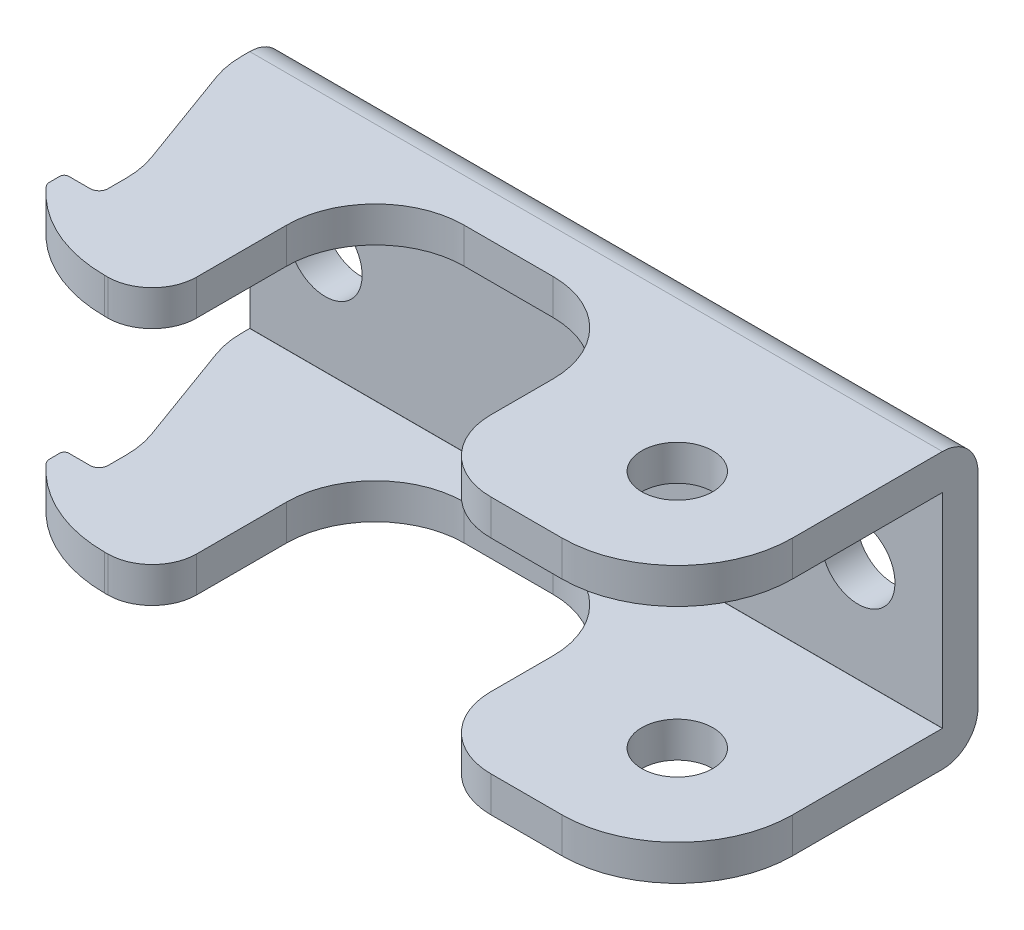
ISO-10303-21;
HEADER;
FILE_DESCRIPTION(('STEP AP214'),'2;1');
FILE_NAME('part.step','',(''),(''),'','','');
FILE_SCHEMA(('AUTOMOTIVE_DESIGN { 1 0 10303 214 1 1 1 1 }'));
ENDSEC;
DATA;
#1=APPLICATION_CONTEXT('core data for automotive mechanical design processes');
#2=APPLICATION_PROTOCOL_DEFINITION('international standard','automotive_design',2000,#1);
#3=PRODUCT_CONTEXT('',#1,'mechanical');
#4=PRODUCT('Part','Part','',(#3));
#5=PRODUCT_RELATED_PRODUCT_CATEGORY('part','',(#4));
#6=PRODUCT_DEFINITION_FORMATION('','',#4);
#7=PRODUCT_DEFINITION_CONTEXT('part definition',#1,'design');
#8=PRODUCT_DEFINITION('design','',#6,#7);
#9=PRODUCT_DEFINITION_SHAPE('','',#8);
#10=(LENGTH_UNIT() NAMED_UNIT(*) SI_UNIT(.MILLI.,.METRE.));
#11=(NAMED_UNIT(*) PLANE_ANGLE_UNIT() SI_UNIT($,.RADIAN.));
#12=(NAMED_UNIT(*) SI_UNIT($,.STERADIAN.) SOLID_ANGLE_UNIT());
#13=UNCERTAINTY_MEASURE_WITH_UNIT(LENGTH_MEASURE(1.E-05),#10,'distance_accuracy_value','');
#14=(GEOMETRIC_REPRESENTATION_CONTEXT(3) GLOBAL_UNCERTAINTY_ASSIGNED_CONTEXT((#13)) GLOBAL_UNIT_ASSIGNED_CONTEXT((#10,
#11,#12)) REPRESENTATION_CONTEXT('',''));
#15=CARTESIAN_POINT('',(0.,0.,0.));
#16=DIRECTION('',(0.,0.,1.));
#17=DIRECTION('',(1.,0.,0.));
#18=AXIS2_PLACEMENT_3D('',#15,#16,#17);
#19=CARTESIAN_POINT('',(-7.89691044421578,15.5,8.36826827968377));
#20=DIRECTION('',(-0.939692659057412,0.,0.34202003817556));
#21=DIRECTION('',(0.,-1.,0.));
#22=AXIS2_PLACEMENT_3D('',#19,#20,#21);
#23=PLANE('',#22);
#24=DIRECTION('',(-0.34202003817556,0.,-0.939692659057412));
#25=VECTOR('',#24,1.);
#26=CARTESIAN_POINT('',(-7.89691044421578,11.5,8.36826827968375));
#27=LINE('',#26,#25);
#28=CARTESIAN_POINT('',(-3.71629825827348,11.5,19.8544098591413));
#29=VERTEX_POINT('',#28);
#30=CARTESIAN_POINT('',(-7.89691044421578,11.5,8.36826827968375));
#31=VERTEX_POINT('',#30);
#32=EDGE_CURVE('E1035',#29,#31,#27,.T.);
#33=ORIENTED_EDGE('',*,*,#32,.F.);
#34=DIRECTION('',(0.,-1.,0.));
#35=VECTOR('',#34,1.);
#36=CARTESIAN_POINT('',(-3.71629825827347,15.5,19.8544098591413));
#37=LINE('',#36,#35);
#38=CARTESIAN_POINT('',(-3.71629825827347,15.5,19.8544098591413));
#39=VERTEX_POINT('',#38);
#40=EDGE_CURVE('E1029',#39,#29,#37,.T.);
#41=ORIENTED_EDGE('',*,*,#40,.F.);
#42=DIRECTION('',(-0.34202003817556,0.,-0.939692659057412));
#43=VECTOR('',#42,1.);
#44=CARTESIAN_POINT('',(-7.89691044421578,15.5,8.36826827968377));
#45=LINE('',#44,#43);
#46=CARTESIAN_POINT('',(-7.89691044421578,15.5,8.36826827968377));
#47=VERTEX_POINT('',#46);
#48=EDGE_CURVE('E1025',#39,#47,#45,.T.);
#49=ORIENTED_EDGE('',*,*,#48,.T.);
#50=DIRECTION('',(0.,-1.,0.));
#51=VECTOR('',#50,1.);
#52=CARTESIAN_POINT('',(-7.89691044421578,15.5,8.36826827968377));
#53=LINE('',#52,#51);
#54=EDGE_CURVE('E1030',#47,#31,#53,.T.);
#55=ORIENTED_EDGE('',*,*,#54,.T.);
#56=EDGE_LOOP('',(#33,#41,#49,#55));
#57=FACE_BOUND('',#56,.T.);
#58=ADVANCED_FACE('F14',(#57),#23,.T.);
#59=CARTESIAN_POINT('',(-13.1132248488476,15.5,23.2746102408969));
#60=DIRECTION('',(0.,-1.,0.));
#61=DIRECTION('',(0.,0.,1.));
#62=AXIS2_PLACEMENT_3D('',#59,#60,#61);
#63=CYLINDRICAL_SURFACE('',#62,10.);
#64=CARTESIAN_POINT('',(-13.1132248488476,11.5,23.2746102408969));
#65=DIRECTION('',(0.,1.,0.));
#66=DIRECTION('',(0.,0.,1.));
#67=AXIS2_PLACEMENT_3D('',#64,#65,#66);
#68=CIRCLE('',#67,10.);
#69=CARTESIAN_POINT('',(-3.11322484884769,11.5,23.274612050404));
#70=VERTEX_POINT('',#69);
#71=EDGE_CURVE('E1012',#70,#29,#68,.T.);
#72=ORIENTED_EDGE('',*,*,#71,.F.);
#73=DIRECTION('',(0.,-1.,0.));
#74=VECTOR('',#73,1.);
#75=CARTESIAN_POINT('',(-3.11322484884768,15.5,23.274612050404));
#76=LINE('',#75,#74);
#77=CARTESIAN_POINT('',(-3.11322484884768,15.5,23.274612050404));
#78=VERTEX_POINT('',#77);
#79=EDGE_CURVE('E1161',#78,#70,#76,.T.);
#80=ORIENTED_EDGE('',*,*,#79,.F.);
#81=CARTESIAN_POINT('',(-13.1132248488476,15.5,23.2746102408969));
#82=DIRECTION('',(0.,1.,0.));
#83=DIRECTION('',(0.,0.,1.));
#84=AXIS2_PLACEMENT_3D('',#81,#82,#83);
#85=CIRCLE('',#84,10.);
#86=EDGE_CURVE('E1142',#78,#39,#85,.T.);
#87=ORIENTED_EDGE('',*,*,#86,.T.);
#88=ORIENTED_EDGE('',*,*,#40,.T.);
#89=EDGE_LOOP('',(#72,#80,#87,#88));
#90=FACE_BOUND('',#89,.T.);
#91=ADVANCED_FACE('F823',(#90),#63,.F.);
#92=CARTESIAN_POINT('',(-3.11322484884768,15.5,23.274612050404));
#93=DIRECTION('',(-0.999999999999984,0.,-1.80950690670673E-07));
#94=DIRECTION('',(0.,-1.,0.));
#95=AXIS2_PLACEMENT_3D('',#92,#93,#94);
#96=PLANE('',#95);
#97=DIRECTION('',(1.80950690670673E-07,0.,-0.999999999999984));
#98=VECTOR('',#97,1.);
#99=CARTESIAN_POINT('',(-3.11322484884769,11.5,23.274612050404));
#100=LINE('',#99,#98);
#101=CARTESIAN_POINT('',(-3.11322522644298,11.5,25.3613420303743));
#102=VERTEX_POINT('',#101);
#103=EDGE_CURVE('E1008',#102,#70,#100,.T.);
#104=ORIENTED_EDGE('',*,*,#103,.F.);
#105=DIRECTION('',(0.,-1.,0.));
#106=VECTOR('',#105,1.);
#107=CARTESIAN_POINT('',(-3.11322522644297,15.5,25.3613420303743));
#108=LINE('',#107,#106);
#109=CARTESIAN_POINT('',(-3.11322522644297,15.5,25.3613420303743));
#110=VERTEX_POINT('',#109);
#111=EDGE_CURVE('E1046',#110,#102,#108,.T.);
#112=ORIENTED_EDGE('',*,*,#111,.F.);
#113=DIRECTION('',(1.80950690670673E-07,0.,-0.999999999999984));
#114=VECTOR('',#113,1.);
#115=CARTESIAN_POINT('',(-3.11322484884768,15.5,23.274612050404));
#116=LINE('',#115,#114);
#117=EDGE_CURVE('E1249',#110,#78,#116,.T.);
#118=ORIENTED_EDGE('',*,*,#117,.T.);
#119=ORIENTED_EDGE('',*,*,#79,.T.);
#120=EDGE_LOOP('',(#104,#112,#118,#119));
#121=FACE_BOUND('',#120,.T.);
#122=ADVANCED_FACE('F830',(#121),#96,.T.);
#123=CARTESIAN_POINT('',(-4.11322522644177,15.5,25.3613400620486));
#124=DIRECTION('',(0.,-1.,0.));
#125=DIRECTION('',(0.,0.,1.));
#126=AXIS2_PLACEMENT_3D('',#123,#124,#125);
#127=CYLINDRICAL_SURFACE('',#126,1.00000000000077);
#128=CARTESIAN_POINT('',(-4.11322522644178,11.5,25.3613400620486));
#129=DIRECTION('',(0.,1.,0.));
#130=DIRECTION('',(0.,0.,1.));
#131=AXIS2_PLACEMENT_3D('',#128,#129,#130);
#132=CIRCLE('',#131,1.00000000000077);
#133=CARTESIAN_POINT('',(-4.11322540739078,11.5,26.3613400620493));
#134=VERTEX_POINT('',#133);
#135=EDGE_CURVE('E1011',#134,#102,#132,.T.);
#136=ORIENTED_EDGE('',*,*,#135,.F.);
#137=DIRECTION('',(0.,-1.,0.));
#138=VECTOR('',#137,1.);
#139=CARTESIAN_POINT('',(-4.11322540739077,15.5,26.3613400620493));
#140=LINE('',#139,#138);
#141=CARTESIAN_POINT('',(-4.11322540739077,15.5,26.3613400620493));
#142=VERTEX_POINT('',#141);
#143=EDGE_CURVE('E1013',#142,#134,#140,.T.);
#144=ORIENTED_EDGE('',*,*,#143,.F.);
#145=CARTESIAN_POINT('',(-4.11322522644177,15.5,25.3613400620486));
#146=DIRECTION('',(0.,1.,0.));
#147=DIRECTION('',(0.,0.,1.));
#148=AXIS2_PLACEMENT_3D('',#145,#146,#147);
#149=CIRCLE('',#148,1.00000000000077);
#150=EDGE_CURVE('E1018',#142,#110,#149,.T.);
#151=ORIENTED_EDGE('',*,*,#150,.T.);
#152=ORIENTED_EDGE('',*,*,#111,.T.);
#153=EDGE_LOOP('',(#136,#144,#151,#152));
#154=FACE_BOUND('',#153,.T.);
#155=ADVANCED_FACE('F860',(#154),#127,.F.);
#156=CARTESIAN_POINT('',(-4.11322540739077,15.5,26.3613400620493));
#157=DIRECTION('',(1.11679707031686E-06,0.,-0.999999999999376));
#158=DIRECTION('',(0.999999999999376,0.,1.11679707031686E-06));
#159=AXIS2_PLACEMENT_3D('',#156,#157,#158);
#160=PLANE('',#159);
#161=DIRECTION('',(0.999999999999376,0.,1.11679707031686E-06));
#162=VECTOR('',#161,1.);
#163=CARTESIAN_POINT('',(-4.11322540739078,11.5,26.3613400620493));
#164=LINE('',#163,#162);
#165=CARTESIAN_POINT('',(-6.53322560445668,11.5,26.3613373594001));
#166=VERTEX_POINT('',#165);
#167=EDGE_CURVE('E1042',#166,#134,#164,.T.);
#168=ORIENTED_EDGE('',*,*,#167,.F.);
#169=DIRECTION('',(0.,-1.,0.));
#170=VECTOR('',#169,1.);
#171=CARTESIAN_POINT('',(-6.53322560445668,15.5,26.3613373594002));
#172=LINE('',#171,#170);
#173=CARTESIAN_POINT('',(-6.53322560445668,15.5,26.3613373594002));
#174=VERTEX_POINT('',#173);
#175=EDGE_CURVE('E1192',#174,#166,#172,.T.);
#176=ORIENTED_EDGE('',*,*,#175,.F.);
#177=DIRECTION('',(0.999999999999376,0.,1.11679707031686E-06));
#178=VECTOR('',#177,1.);
#179=CARTESIAN_POINT('',(-4.11322540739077,15.5,26.3613400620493));
#180=LINE('',#179,#178);
#181=EDGE_CURVE('E1017',#174,#142,#180,.T.);
#182=ORIENTED_EDGE('',*,*,#181,.T.);
#183=ORIENTED_EDGE('',*,*,#143,.T.);
#184=EDGE_LOOP('',(#168,#176,#182,#183));
#185=FACE_BOUND('',#184,.T.);
#186=ADVANCED_FACE('F856',(#185),#160,.T.);
#187=CARTESIAN_POINT('',(-6.53322748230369,15.5,26.8613391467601));
#188=DIRECTION('',(0.,-1.,0.));
#189=DIRECTION('',(0.,0.,1.));
#190=AXIS2_PLACEMENT_3D('',#187,#188,#189);
#191=CYLINDRICAL_SURFACE('',#190,0.500001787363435);
#192=CARTESIAN_POINT('',(-6.53322748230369,11.5,26.8613391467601));
#193=DIRECTION('',(0.,-1.,0.));
#194=DIRECTION('',(0.,0.,1.));
#195=AXIS2_PLACEMENT_3D('',#192,#193,#194);
#196=CIRCLE('',#195,0.500001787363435);
#197=CARTESIAN_POINT('',(-7.03322926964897,11.5,26.861334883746));
#198=VERTEX_POINT('',#197);
#199=EDGE_CURVE('E1151',#198,#166,#196,.T.);
#200=ORIENTED_EDGE('',*,*,#199,.F.);
#201=DIRECTION('',(0.,-1.,0.));
#202=VECTOR('',#201,1.);
#203=CARTESIAN_POINT('',(-7.03322926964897,15.5,26.861334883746));
#204=LINE('',#203,#202);
#205=CARTESIAN_POINT('',(-7.03322926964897,15.5,26.861334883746));
#206=VERTEX_POINT('',#205);
#207=EDGE_CURVE('E1024',#206,#198,#204,.T.);
#208=ORIENTED_EDGE('',*,*,#207,.F.);
#209=CARTESIAN_POINT('',(-6.53322748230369,15.5,26.8613391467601));
#210=DIRECTION('',(0.,-1.,0.));
#211=DIRECTION('',(0.,0.,1.));
#212=AXIS2_PLACEMENT_3D('',#209,#210,#211);
#213=CIRCLE('',#212,0.500001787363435);
#214=EDGE_CURVE('E1169',#206,#174,#213,.T.);
#215=ORIENTED_EDGE('',*,*,#214,.T.);
#216=ORIENTED_EDGE('',*,*,#175,.T.);
#217=EDGE_LOOP('',(#200,#208,#215,#216));
#218=FACE_BOUND('',#217,.T.);
#219=ADVANCED_FACE('F859',(#218),#191,.T.);
#220=CARTESIAN_POINT('',(-7.03322926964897,15.5,26.861334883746));
#221=DIRECTION('',(-0.999999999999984,0.,-1.80950712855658E-07));
#222=DIRECTION('',(0.,-1.,0.));
#223=AXIS2_PLACEMENT_3D('',#220,#221,#222);
#224=PLANE('',#223);
#225=DIRECTION('',(1.80950712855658E-07,0.,-0.999999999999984));
#226=VECTOR('',#225,1.);
#227=CARTESIAN_POINT('',(-7.03322926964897,11.5,26.861334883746));
#228=LINE('',#227,#226);
#229=CARTESIAN_POINT('',(-7.03322947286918,11.5,27.9844043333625));
#230=VERTEX_POINT('',#229);
#231=EDGE_CURVE('E1051',#230,#198,#228,.T.);
#232=ORIENTED_EDGE('',*,*,#231,.F.);
#233=DIRECTION('',(0.,-1.,0.));
#234=VECTOR('',#233,1.);
#235=CARTESIAN_POINT('',(-7.03322947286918,15.5,27.9844043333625));
#236=LINE('',#235,#234);
#237=CARTESIAN_POINT('',(-7.03322947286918,15.5,27.9844043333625));
#238=VERTEX_POINT('',#237);
#239=EDGE_CURVE('E1023',#238,#230,#236,.T.);
#240=ORIENTED_EDGE('',*,*,#239,.F.);
#241=DIRECTION('',(1.80950712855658E-07,0.,-0.999999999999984));
#242=VECTOR('',#241,1.);
#243=CARTESIAN_POINT('',(-7.03322926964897,15.5,26.861334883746));
#244=LINE('',#243,#242);
#245=EDGE_CURVE('E1019',#238,#206,#244,.T.);
#246=ORIENTED_EDGE('',*,*,#245,.T.);
#247=ORIENTED_EDGE('',*,*,#207,.T.);
#248=EDGE_LOOP('',(#232,#240,#246,#247));
#249=FACE_BOUND('',#248,.T.);
#250=ADVANCED_FACE('F883',(#249),#224,.T.);
#251=CARTESIAN_POINT('',(-6.03322947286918,15.5,27.9844045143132));
#252=DIRECTION('',(0.,-1.,0.));
#253=DIRECTION('',(0.,0.,1.));
#254=AXIS2_PLACEMENT_3D('',#251,#252,#253);
#255=CYLINDRICAL_SURFACE('',#254,1.00000000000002);
#256=CARTESIAN_POINT('',(-6.03322947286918,11.5,27.9844045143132));
#257=DIRECTION('',(0.,-1.,0.));
#258=DIRECTION('',(0.,0.,1.));
#259=AXIS2_PLACEMENT_3D('',#256,#257,#258);
#260=CIRCLE('',#259,1.00000000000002);
#261=CARTESIAN_POINT('',(-6.77890528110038,11.5,28.6507134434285));
#262=VERTEX_POINT('',#261);
#263=EDGE_CURVE('E1047',#262,#230,#260,.T.);
#264=ORIENTED_EDGE('',*,*,#263,.F.);
#265=DIRECTION('',(0.,-1.,0.));
#266=VECTOR('',#265,1.);
#267=CARTESIAN_POINT('',(-6.77890528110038,15.5,28.6507134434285));
#268=LINE('',#267,#266);
#269=CARTESIAN_POINT('',(-6.77890528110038,15.5,28.6507134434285));
#270=VERTEX_POINT('',#269);
#271=EDGE_CURVE('E1094',#270,#262,#268,.T.);
#272=ORIENTED_EDGE('',*,*,#271,.F.);
#273=CARTESIAN_POINT('',(-6.03322947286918,15.5,27.9844045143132));
#274=DIRECTION('',(0.,-1.,0.));
#275=DIRECTION('',(0.,0.,1.));
#276=AXIS2_PLACEMENT_3D('',#273,#274,#275);
#277=CIRCLE('',#276,1.00000000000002);
#278=EDGE_CURVE('E1099',#270,#238,#277,.T.);
#279=ORIENTED_EDGE('',*,*,#278,.T.);
#280=ORIENTED_EDGE('',*,*,#239,.T.);
#281=EDGE_LOOP('',(#264,#272,#279,#280));
#282=FACE_BOUND('',#281,.T.);
#283=ADVANCED_FACE('F960',(#282),#255,.T.);
#284=CARTESIAN_POINT('',(5.15190765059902,15.5,17.9897705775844));
#285=DIRECTION('',(0.,-1.,0.));
#286=DIRECTION('',(0.,0.,1.));
#287=AXIS2_PLACEMENT_3D('',#284,#285,#286);
#288=CYLINDRICAL_SURFACE('',#287,16.);
#289=CARTESIAN_POINT('',(5.15190765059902,11.5,17.9897705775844));
#290=DIRECTION('',(0.,-1.,0.));
#291=DIRECTION('',(0.,0.,1.));
#292=AXIS2_PLACEMENT_3D('',#289,#290,#291);
#293=CIRCLE('',#292,16.);
#294=CARTESIAN_POINT('',(5.15190475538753,11.5,33.9897705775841));
#295=VERTEX_POINT('',#294);
#296=EDGE_CURVE('E1050',#295,#262,#293,.T.);
#297=ORIENTED_EDGE('',*,*,#296,.F.);
#298=DIRECTION('',(0.,-1.,0.));
#299=VECTOR('',#298,1.);
#300=CARTESIAN_POINT('',(5.15190475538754,15.5,33.9897705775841));
#301=LINE('',#300,#299);
#302=CARTESIAN_POINT('',(5.15190475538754,15.5,33.9897705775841));
#303=VERTEX_POINT('',#302);
#304=EDGE_CURVE('E1131',#303,#295,#301,.T.);
#305=ORIENTED_EDGE('',*,*,#304,.F.);
#306=CARTESIAN_POINT('',(5.15190765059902,15.5,17.9897705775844));
#307=DIRECTION('',(0.,-1.,0.));
#308=DIRECTION('',(0.,0.,1.));
#309=AXIS2_PLACEMENT_3D('',#306,#307,#308);
#310=CIRCLE('',#309,16.);
#311=EDGE_CURVE('E1098',#303,#270,#310,.T.);
#312=ORIENTED_EDGE('',*,*,#311,.T.);
#313=ORIENTED_EDGE('',*,*,#271,.T.);
#314=EDGE_LOOP('',(#297,#305,#312,#313));
#315=FACE_BOUND('',#314,.T.);
#316=ADVANCED_FACE('F957',(#315),#288,.T.);
#317=CARTESIAN_POINT('',(5.15190475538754,15.5,33.9897705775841));
#318=DIRECTION('',(-3.61900883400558E-07,0.,0.999999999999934));
#319=DIRECTION('',(9.6476169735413E-09,-1.,0.));
#320=AXIS2_PLACEMENT_3D('',#317,#318,#319);
#321=PLANE('',#320);
#322=DIRECTION('',(-0.999999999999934,0.,-3.61900883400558E-07));
#323=VECTOR('',#322,1.);
#324=CARTESIAN_POINT('',(5.15190475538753,11.5,33.9897705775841));
#325=LINE('',#324,#323);
#326=CARTESIAN_POINT('',(5.50001273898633,11.5,33.9897707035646));
#327=VERTEX_POINT('',#326);
#328=EDGE_CURVE('E997',#327,#295,#325,.T.);
#329=ORIENTED_EDGE('',*,*,#328,.F.);
#330=DIRECTION('',(0.,-1.,0.));
#331=VECTOR('',#330,1.);
#332=CARTESIAN_POINT('',(5.50001273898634,15.5,33.9897707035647));
#333=LINE('',#332,#331);
#334=CARTESIAN_POINT('',(5.50001273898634,15.5,33.9897707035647));
#335=VERTEX_POINT('',#334);
#336=EDGE_CURVE('E1165',#335,#327,#333,.T.);
#337=ORIENTED_EDGE('',*,*,#336,.F.);
#338=DIRECTION('',(-0.999999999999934,0.,-3.61900883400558E-07));
#339=VECTOR('',#338,1.);
#340=CARTESIAN_POINT('',(5.15190475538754,15.5,33.9897705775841));
#341=LINE('',#340,#339);
#342=EDGE_CURVE('E1157',#335,#303,#341,.T.);
#343=ORIENTED_EDGE('',*,*,#342,.T.);
#344=ORIENTED_EDGE('',*,*,#304,.T.);
#345=EDGE_LOOP('',(#329,#337,#343,#344));
#346=FACE_BOUND('',#345,.T.);
#347=ADVANCED_FACE('F879',(#346),#321,.T.);
#348=CARTESIAN_POINT('',(5.50001364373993,15.5,28.9897707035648));
#349=DIRECTION('',(0.,-1.,0.));
#350=DIRECTION('',(0.,0.,1.));
#351=AXIS2_PLACEMENT_3D('',#348,#349,#350);
#352=CYLINDRICAL_SURFACE('',#351,5.);
#353=CARTESIAN_POINT('',(5.50001364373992,11.5,28.9897707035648));
#354=DIRECTION('',(0.,-1.,0.));
#355=DIRECTION('',(0.,0.,1.));
#356=AXIS2_PLACEMENT_3D('',#353,#354,#355);
#357=CIRCLE('',#356,5.);
#358=CARTESIAN_POINT('',(10.5000136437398,11.5,28.9897716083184));
#359=VERTEX_POINT('',#358);
#360=EDGE_CURVE('E989',#359,#327,#357,.T.);
#361=ORIENTED_EDGE('',*,*,#360,.F.);
#362=DIRECTION('',(0.,-1.,0.));
#363=VECTOR('',#362,1.);
#364=CARTESIAN_POINT('',(10.5000136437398,15.5,28.9897716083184));
#365=LINE('',#364,#363);
#366=CARTESIAN_POINT('',(10.5000136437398,15.5,28.9897716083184));
#367=VERTEX_POINT('',#366);
#368=EDGE_CURVE('E985',#367,#359,#365,.T.);
#369=ORIENTED_EDGE('',*,*,#368,.F.);
#370=CARTESIAN_POINT('',(5.50001364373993,15.5,28.9897707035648));
#371=DIRECTION('',(0.,-1.,0.));
#372=DIRECTION('',(0.,0.,1.));
#373=AXIS2_PLACEMENT_3D('',#370,#371,#372);
#374=CIRCLE('',#373,5.);
#375=EDGE_CURVE('E1092',#367,#335,#374,.T.);
#376=ORIENTED_EDGE('',*,*,#375,.T.);
#377=ORIENTED_EDGE('',*,*,#336,.T.);
#378=EDGE_LOOP('',(#361,#369,#376,#377));
#379=FACE_BOUND('',#378,.T.);
#380=ADVANCED_FACE('F875',(#379),#352,.T.);
#381=CARTESIAN_POINT('',(10.5000136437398,15.5,28.9897716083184));
#382=DIRECTION('',(0.999999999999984,0.,1.80950718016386E-07));
#383=DIRECTION('',(0.,1.,0.));
#384=AXIS2_PLACEMENT_3D('',#381,#382,#383);
#385=PLANE('',#384);
#386=DIRECTION('',(-1.80950718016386E-07,0.,0.999999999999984));
#387=VECTOR('',#386,1.);
#388=CARTESIAN_POINT('',(10.5000136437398,11.5,28.9897716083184));
#389=LINE('',#388,#387);
#390=CARTESIAN_POINT('',(10.5000154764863,11.5,18.8613422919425));
#391=VERTEX_POINT('',#390);
#392=EDGE_CURVE('E980',#391,#359,#389,.T.);
#393=ORIENTED_EDGE('',*,*,#392,.F.);
#394=DIRECTION('',(0.,-1.,0.));
#395=VECTOR('',#394,1.);
#396=CARTESIAN_POINT('',(10.5000154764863,15.5,18.8613422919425));
#397=LINE('',#396,#395);
#398=CARTESIAN_POINT('',(10.5000154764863,15.5,18.8613422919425));
#399=VERTEX_POINT('',#398);
#400=EDGE_CURVE('E983',#399,#391,#397,.T.);
#401=ORIENTED_EDGE('',*,*,#400,.F.);
#402=DIRECTION('',(-1.80950718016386E-07,0.,0.999999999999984));
#403=VECTOR('',#402,1.);
#404=CARTESIAN_POINT('',(10.5000136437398,15.5,28.9897716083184));
#405=LINE('',#404,#403);
#406=EDGE_CURVE('E1145',#399,#367,#405,.T.);
#407=ORIENTED_EDGE('',*,*,#406,.T.);
#408=ORIENTED_EDGE('',*,*,#368,.T.);
#409=EDGE_LOOP('',(#393,#401,#407,#408));
#410=FACE_BOUND('',#409,.T.);
#411=ADVANCED_FACE('F878',(#410),#385,.T.);
#412=CARTESIAN_POINT('',(20.5000154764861,15.5,18.8613441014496));
#413=DIRECTION('',(0.,-1.,0.));
#414=DIRECTION('',(0.,0.,1.));
#415=AXIS2_PLACEMENT_3D('',#412,#413,#414);
#416=CYLINDRICAL_SURFACE('',#415,10.);
#417=CARTESIAN_POINT('',(20.5000154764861,11.5,18.8613441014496));
#418=DIRECTION('',(0.,1.,0.));
#419=DIRECTION('',(0.,0.,1.));
#420=AXIS2_PLACEMENT_3D('',#417,#418,#419);
#421=CIRCLE('',#420,10.);
#422=CARTESIAN_POINT('',(20.5000172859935,11.5,8.86134410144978));
#423=VERTEX_POINT('',#422);
#424=EDGE_CURVE('E988',#423,#391,#421,.T.);
#425=ORIENTED_EDGE('',*,*,#424,.F.);
#426=DIRECTION('',(0.,-1.,0.));
#427=VECTOR('',#426,1.);
#428=CARTESIAN_POINT('',(20.5000172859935,15.5,8.86134410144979));
#429=LINE('',#428,#427);
#430=CARTESIAN_POINT('',(20.5000172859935,15.5,8.86134410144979));
#431=VERTEX_POINT('',#430);
#432=EDGE_CURVE('E1108',#431,#423,#429,.T.);
#433=ORIENTED_EDGE('',*,*,#432,.F.);
#434=CARTESIAN_POINT('',(20.5000154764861,15.5,18.8613441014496));
#435=DIRECTION('',(0.,1.,0.));
#436=DIRECTION('',(0.,0.,1.));
#437=AXIS2_PLACEMENT_3D('',#434,#435,#436);
#438=CIRCLE('',#437,10.);
#439=EDGE_CURVE('E1105',#431,#399,#438,.T.);
#440=ORIENTED_EDGE('',*,*,#439,.T.);
#441=ORIENTED_EDGE('',*,*,#400,.T.);
#442=EDGE_LOOP('',(#425,#433,#440,#441));
#443=FACE_BOUND('',#442,.T.);
#444=ADVANCED_FACE('F949',(#443),#416,.F.);
#445=CARTESIAN_POINT('',(25.5000180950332,15.5,8.86134500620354));
#446=DIRECTION('',(-1.80950718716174E-07,0.,0.999999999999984));
#447=DIRECTION('',(1.92952049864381E-08,-1.,0.));
#448=AXIS2_PLACEMENT_3D('',#445,#446,#447);
#449=PLANE('',#448);
#450=DIRECTION('',(-0.999999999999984,0.,-1.80950718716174E-07));
#451=VECTOR('',#450,1.);
#452=CARTESIAN_POINT('',(25.5000180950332,11.5,8.86134500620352));
#453=LINE('',#452,#451);
#454=CARTESIAN_POINT('',(30.5000172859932,11.5,8.86134591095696));
#455=VERTEX_POINT('',#454);
#456=EDGE_CURVE('E994',#455,#423,#453,.T.);
#457=ORIENTED_EDGE('',*,*,#456,.F.);
#458=DIRECTION('',(0.,-1.,0.));
#459=VECTOR('',#458,1.);
#460=CARTESIAN_POINT('',(30.5000172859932,15.5,8.86134591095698));
#461=LINE('',#460,#459);
#462=CARTESIAN_POINT('',(30.5000172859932,15.5,8.86134591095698));
#463=VERTEX_POINT('',#462);
#464=EDGE_CURVE('E1223',#463,#455,#461,.T.);
#465=ORIENTED_EDGE('',*,*,#464,.F.);
#466=DIRECTION('',(-0.999999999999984,0.,-1.80950716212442E-07));
#467=VECTOR('',#466,1.);
#468=CARTESIAN_POINT('',(25.5000180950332,15.5,8.86134500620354));
#469=LINE('',#468,#467);
#470=EDGE_CURVE('E1138',#463,#431,#469,.T.);
#471=ORIENTED_EDGE('',*,*,#470,.T.);
#472=ORIENTED_EDGE('',*,*,#432,.T.);
#473=EDGE_LOOP('',(#457,#465,#471,#472));
#474=FACE_BOUND('',#473,.T.);
#475=ADVANCED_FACE('F946',(#474),#449,.T.);
#476=CARTESIAN_POINT('',(30.500015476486,15.5,18.8613459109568));
#477=DIRECTION('',(0.,-1.,0.));
#478=DIRECTION('',(0.,0.,1.));
#479=AXIS2_PLACEMENT_3D('',#476,#477,#478);
#480=CYLINDRICAL_SURFACE('',#479,10.);
#481=CARTESIAN_POINT('',(30.500015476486,11.5,18.8613459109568));
#482=DIRECTION('',(0.,1.,0.));
#483=DIRECTION('',(0.,0.,1.));
#484=AXIS2_PLACEMENT_3D('',#481,#482,#483);
#485=CIRCLE('',#484,10.);
#486=CARTESIAN_POINT('',(40.5000154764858,11.5,18.861347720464));
#487=VERTEX_POINT('',#486);
#488=EDGE_CURVE('E1124',#487,#455,#485,.T.);
#489=ORIENTED_EDGE('',*,*,#488,.F.);
#490=DIRECTION('',(0.,-1.,0.));
#491=VECTOR('',#490,1.);
#492=CARTESIAN_POINT('',(40.5000154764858,15.5,18.861347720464));
#493=LINE('',#492,#491);
#494=CARTESIAN_POINT('',(40.5000154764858,15.5,18.861347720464));
#495=VERTEX_POINT('',#494);
#496=EDGE_CURVE('E1109',#495,#487,#493,.T.);
#497=ORIENTED_EDGE('',*,*,#496,.F.);
#498=CARTESIAN_POINT('',(30.500015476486,15.5,18.8613459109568));
#499=DIRECTION('',(0.,1.,0.));
#500=DIRECTION('',(0.,0.,1.));
#501=AXIS2_PLACEMENT_3D('',#498,#499,#500);
#502=CIRCLE('',#501,10.);
#503=EDGE_CURVE('E1114',#495,#463,#502,.T.);
#504=ORIENTED_EDGE('',*,*,#503,.T.);
#505=ORIENTED_EDGE('',*,*,#464,.T.);
#506=EDGE_LOOP('',(#489,#497,#504,#505));
#507=FACE_BOUND('',#506,.T.);
#508=ADVANCED_FACE('F865',(#507),#480,.F.);
#509=CARTESIAN_POINT('',(40.5000154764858,15.5,18.861347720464));
#510=DIRECTION('',(-0.999999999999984,0.,-1.80950715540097E-07));
#511=DIRECTION('',(0.,-1.,0.));
#512=AXIS2_PLACEMENT_3D('',#509,#510,#511);
#513=PLANE('',#512);
#514=DIRECTION('',(1.80950715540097E-07,0.,-0.999999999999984));
#515=VECTOR('',#514,1.);
#516=CARTESIAN_POINT('',(40.5000154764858,11.5,18.861347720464));
#517=LINE('',#516,#515);
#518=CARTESIAN_POINT('',(40.5000142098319,11.5,25.8613415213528));
#519=VERTEX_POINT('',#518);
#520=EDGE_CURVE('E1007',#519,#487,#517,.T.);
#521=ORIENTED_EDGE('',*,*,#520,.F.);
#522=DIRECTION('',(0.,-1.,0.));
#523=VECTOR('',#522,1.);
#524=CARTESIAN_POINT('',(40.5000142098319,15.5,25.8613415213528));
#525=LINE('',#524,#523);
#526=CARTESIAN_POINT('',(40.5000142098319,15.5,25.8613415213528));
#527=VERTEX_POINT('',#526);
#528=EDGE_CURVE('E1178',#527,#519,#525,.T.);
#529=ORIENTED_EDGE('',*,*,#528,.F.);
#530=DIRECTION('',(1.80950715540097E-07,0.,-0.999999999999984));
#531=VECTOR('',#530,1.);
#532=CARTESIAN_POINT('',(40.5000154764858,15.5,18.861347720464));
#533=LINE('',#532,#531);
#534=EDGE_CURVE('E1113',#527,#495,#533,.T.);
#535=ORIENTED_EDGE('',*,*,#534,.T.);
#536=ORIENTED_EDGE('',*,*,#496,.T.);
#537=EDGE_LOOP('',(#521,#529,#535,#536));
#538=FACE_BOUND('',#537,.T.);
#539=ADVANCED_FACE('F862',(#538),#513,.T.);
#540=CARTESIAN_POINT('',(48.5000156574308,15.5,25.8613491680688));
#541=DIRECTION('',(0.,-1.,0.));
#542=DIRECTION('',(0.,0.,1.));
#543=AXIS2_PLACEMENT_3D('',#540,#541,#542);
#544=CYLINDRICAL_SURFACE('',#543,8.00000144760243);
#545=CARTESIAN_POINT('',(48.5000156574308,11.5,25.8613491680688));
#546=DIRECTION('',(0.,-1.,0.));
#547=DIRECTION('',(0.,0.,1.));
#548=AXIS2_PLACEMENT_3D('',#545,#546,#547);
#549=CIRCLE('',#548,8.00000144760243);
#550=CARTESIAN_POINT('',(48.5000156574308,11.5,33.8613506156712));
#551=VERTEX_POINT('',#550);
#552=EDGE_CURVE('E1003',#551,#519,#549,.T.);
#553=ORIENTED_EDGE('',*,*,#552,.F.);
#554=DIRECTION('',(0.,-1.,0.));
#555=VECTOR('',#554,1.);
#556=CARTESIAN_POINT('',(48.5000156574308,15.5,33.8613506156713));
#557=LINE('',#556,#555);
#558=CARTESIAN_POINT('',(48.5000156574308,15.5,33.8613506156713));
#559=VERTEX_POINT('',#558);
#560=EDGE_CURVE('E1193',#559,#551,#557,.T.);
#561=ORIENTED_EDGE('',*,*,#560,.F.);
#562=CARTESIAN_POINT('',(48.5000156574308,15.5,25.8613491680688));
#563=DIRECTION('',(0.,-1.,0.));
#564=DIRECTION('',(0.,0.,1.));
#565=AXIS2_PLACEMENT_3D('',#562,#563,#564);
#566=CIRCLE('',#565,8.00000144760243);
#567=EDGE_CURVE('E1000',#559,#527,#566,.T.);
#568=ORIENTED_EDGE('',*,*,#567,.T.);
#569=ORIENTED_EDGE('',*,*,#528,.T.);
#570=EDGE_LOOP('',(#553,#561,#568,#569));
#571=FACE_BOUND('',#570,.T.);
#572=ADVANCED_FACE('F851',(#571),#544,.T.);
#573=CARTESIAN_POINT('',(56.5,15.5,33.8613506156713));
#574=DIRECTION('',(0.,0.,1.));
#575=DIRECTION('',(-1.,0.,0.));
#576=AXIS2_PLACEMENT_3D('',#573,#574,#575);
#577=PLANE('',#576);
#578=DIRECTION('',(-1.,0.,0.));
#579=VECTOR('',#578,1.);
#580=CARTESIAN_POINT('',(56.5,11.5,33.8613506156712));
#581=LINE('',#580,#579);
#582=CARTESIAN_POINT('',(56.5,11.5,33.8613506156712));
#583=VERTEX_POINT('',#582);
#584=EDGE_CURVE('E1006',#583,#551,#581,.T.);
#585=ORIENTED_EDGE('',*,*,#584,.F.);
#586=DIRECTION('',(0.,-1.,0.));
#587=VECTOR('',#586,1.);
#588=CARTESIAN_POINT('',(56.5,15.5,33.8613506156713));
#589=LINE('',#588,#587);
#590=CARTESIAN_POINT('',(56.5,15.5,33.8613506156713));
#591=VERTEX_POINT('',#590);
#592=EDGE_CURVE('E1119',#591,#583,#589,.T.);
#593=ORIENTED_EDGE('',*,*,#592,.F.);
#594=DIRECTION('',(-1.,0.,0.));
#595=VECTOR('',#594,1.);
#596=CARTESIAN_POINT('',(56.5,15.5,33.8613506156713));
#597=LINE('',#596,#595);
#598=EDGE_CURVE('E1123',#591,#559,#597,.T.);
#599=ORIENTED_EDGE('',*,*,#598,.T.);
#600=ORIENTED_EDGE('',*,*,#560,.T.);
#601=EDGE_LOOP('',(#585,#593,#599,#600));
#602=FACE_BOUND('',#601,.T.);
#603=ADVANCED_FACE('F848',(#602),#577,.T.);
#604=CARTESIAN_POINT('',(56.5,15.5,20.8613506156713));
#605=DIRECTION('',(0.,-1.,0.));
#606=DIRECTION('',(0.,0.,1.));
#607=AXIS2_PLACEMENT_3D('',#604,#605,#606);
#608=CYLINDRICAL_SURFACE('',#607,13.);
#609=CARTESIAN_POINT('',(56.5,11.5,20.8613506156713));
#610=DIRECTION('',(0.,-1.,0.));
#611=DIRECTION('',(0.,0.,1.));
#612=AXIS2_PLACEMENT_3D('',#609,#610,#611);
#613=CIRCLE('',#612,13.);
#614=CARTESIAN_POINT('',(69.5,11.5,20.8613491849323));
#615=VERTEX_POINT('',#614);
#616=EDGE_CURVE('E1031',#615,#583,#613,.T.);
#617=ORIENTED_EDGE('',*,*,#616,.F.);
#618=DIRECTION('',(0.,-1.,0.));
#619=VECTOR('',#618,1.);
#620=CARTESIAN_POINT('',(69.5,15.5,20.8613491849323));
#621=LINE('',#620,#619);
#622=CARTESIAN_POINT('',(69.5,15.5,20.8613491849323));
#623=VERTEX_POINT('',#622);
#624=EDGE_CURVE('E420',#623,#615,#621,.T.);
#625=ORIENTED_EDGE('',*,*,#624,.F.);
#626=CARTESIAN_POINT('',(56.5,15.5,20.8613506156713));
#627=DIRECTION('',(0.,-1.,0.));
#628=DIRECTION('',(0.,0.,1.));
#629=AXIS2_PLACEMENT_3D('',#626,#627,#628);
#630=CIRCLE('',#629,13.);
#631=EDGE_CURVE('E1060',#623,#591,#630,.T.);
#632=ORIENTED_EDGE('',*,*,#631,.T.);
#633=ORIENTED_EDGE('',*,*,#592,.T.);
#634=EDGE_LOOP('',(#617,#625,#632,#633));
#635=FACE_BOUND('',#634,.T.);
#636=ADVANCED_FACE('F841',(#635),#608,.T.);
#637=CARTESIAN_POINT('',(1.50001614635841,15.5,4.94806789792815));
#638=DIRECTION('',(0.,-1.,0.));
#639=DIRECTION('',(0.,0.,1.));
#640=AXIS2_PLACEMENT_3D('',#637,#638,#639);
#641=CYLINDRICAL_SURFACE('',#640,10.);
#642=CARTESIAN_POINT('',(1.5000161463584,11.5,4.94806789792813));
#643=DIRECTION('',(0.,-1.,0.));
#644=DIRECTION('',(0.,0.,1.));
#645=AXIS2_PLACEMENT_3D('',#642,#643,#644);
#646=CIRCLE('',#645,10.);
#647=CARTESIAN_POINT('',(-8.49998385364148,11.5,4.94806608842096));
#648=VERTEX_POINT('',#647);
#649=EDGE_CURVE('E1039',#31,#648,#646,.T.);
#650=ORIENTED_EDGE('',*,*,#649,.F.);
#651=ORIENTED_EDGE('',*,*,#54,.F.);
#652=CARTESIAN_POINT('',(1.50001614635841,15.5,4.94806789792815));
#653=DIRECTION('',(0.,-1.,0.));
#654=DIRECTION('',(0.,0.,1.));
#655=AXIS2_PLACEMENT_3D('',#652,#653,#654);
#656=CIRCLE('',#655,10.);
#657=CARTESIAN_POINT('',(-8.49998385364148,15.5,4.94806608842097));
#658=VERTEX_POINT('',#657);
#659=EDGE_CURVE('E1104',#47,#658,#656,.T.);
#660=ORIENTED_EDGE('',*,*,#659,.T.);
#661=DIRECTION('',(0.,-1.,0.));
#662=VECTOR('',#661,1.);
#663=CARTESIAN_POINT('',(-8.49998385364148,15.5,4.94806608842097));
#664=LINE('',#663,#662);
#665=EDGE_CURVE('E1100',#658,#648,#664,.T.);
#666=ORIENTED_EDGE('',*,*,#665,.T.);
#667=EDGE_LOOP('',(#650,#651,#660,#666));
#668=FACE_BOUND('',#667,.T.);
#669=ADVANCED_FACE('F837',(#668),#641,.T.);
#670=CARTESIAN_POINT('',(56.5385185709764,15.5000000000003,-42.1386493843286));
#671=DIRECTION('',(0.,-1.,0.));
#672=DIRECTION('',(0.,0.,-1.));
#673=AXIS2_PLACEMENT_3D('',#670,#671,#672);
#674=PLANE('',#673);
#675=DIRECTION('',(1.,0.,0.));
#676=VECTOR('',#675,1.);
#677=CARTESIAN_POINT('',(56.5385185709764,15.5,4.01));
#678=LINE('',#677,#676);
#679=CARTESIAN_POINT('',(-8.49998368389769,15.5,4.00999999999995));
#680=VERTEX_POINT('',#679);
#681=CARTESIAN_POINT('',(69.5,15.5,4.00999999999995));
#682=VERTEX_POINT('',#681);
#683=EDGE_CURVE('E454',#680,#682,#678,.T.);
#684=ORIENTED_EDGE('',*,*,#683,.F.);
#685=DIRECTION('',(1.80950718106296E-07,0.,-0.999999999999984));
#686=VECTOR('',#685,1.);
#687=CARTESIAN_POINT('',(-8.49998112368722,15.5,-10.1386621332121));
#688=LINE('',#687,#686);
#689=EDGE_CURVE('E769',#658,#680,#688,.T.);
#690=ORIENTED_EDGE('',*,*,#689,.F.);
#691=ORIENTED_EDGE('',*,*,#659,.F.);
#692=ORIENTED_EDGE('',*,*,#48,.F.);
#693=ORIENTED_EDGE('',*,*,#86,.F.);
#694=ORIENTED_EDGE('',*,*,#117,.F.);
#695=ORIENTED_EDGE('',*,*,#150,.F.);
#696=ORIENTED_EDGE('',*,*,#181,.F.);
#697=ORIENTED_EDGE('',*,*,#214,.F.);
#698=ORIENTED_EDGE('',*,*,#245,.F.);
#699=ORIENTED_EDGE('',*,*,#278,.F.);
#700=ORIENTED_EDGE('',*,*,#311,.F.);
#701=ORIENTED_EDGE('',*,*,#342,.F.);
#702=ORIENTED_EDGE('',*,*,#375,.F.);
#703=ORIENTED_EDGE('',*,*,#406,.F.);
#704=ORIENTED_EDGE('',*,*,#439,.F.);
#705=ORIENTED_EDGE('',*,*,#470,.F.);
#706=ORIENTED_EDGE('',*,*,#503,.F.);
#707=ORIENTED_EDGE('',*,*,#534,.F.);
#708=ORIENTED_EDGE('',*,*,#567,.F.);
#709=ORIENTED_EDGE('',*,*,#598,.F.);
#710=ORIENTED_EDGE('',*,*,#631,.F.);
#711=DIRECTION('',(0.,0.,1.));
#712=VECTOR('',#711,1.);
#713=CARTESIAN_POINT('',(69.5,15.5000000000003,-41.1386498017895));
#714=LINE('',#713,#712);
#715=EDGE_CURVE('E428',#682,#623,#714,.T.);
#716=ORIENTED_EDGE('',*,*,#715,.F.);
#717=EDGE_LOOP('',(#684,#690,#691,#692,#693,#694,#695,#696,#697,#698,#699,#700,#701,#702,#703,
#704,#705,#706,#707,#708,#709,#710,#716));
#718=FACE_BOUND('',#717,.T.);
#719=CARTESIAN_POINT('',(56.5,15.5,20.8613506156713));
#720=DIRECTION('',(0.,1.,0.));
#721=DIRECTION('',(-1.,0.,0.));
#722=AXIS2_PLACEMENT_3D('',#719,#720,#721);
#723=CIRCLE('',#722,4.);
#724=CARTESIAN_POINT('',(52.5,15.5,20.8613506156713));
#725=VERTEX_POINT('',#724);
#726=EDGE_CURVE('E1365',#725,#725,#723,.T.);
#727=ORIENTED_EDGE('',*,*,#726,.F.);
#728=EDGE_LOOP('',(#727));
#729=FACE_BOUND('',#728,.T.);
#730=ADVANCED_FACE('F840',(#718,#729),#674,.F.);
#731=CARTESIAN_POINT('',(56.5385185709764,11.5000000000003,-42.1386493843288));
#732=DIRECTION('',(0.,-1.,0.));
#733=DIRECTION('',(0.,0.,-1.));
#734=AXIS2_PLACEMENT_3D('',#731,#732,#733);
#735=PLANE('',#734);
#736=DIRECTION('',(1.80950714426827E-07,0.,-0.999999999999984));
#737=VECTOR('',#736,1.);
#738=CARTESIAN_POINT('',(-8.49998112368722,11.5000000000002,-10.1386621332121));
#739=LINE('',#738,#737);
#740=CARTESIAN_POINT('',(-8.49998368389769,11.5,4.01));
#741=VERTEX_POINT('',#740);
#742=EDGE_CURVE('E1065',#648,#741,#739,.T.);
#743=ORIENTED_EDGE('',*,*,#742,.T.);
#744=DIRECTION('',(1.,0.,0.));
#745=VECTOR('',#744,1.);
#746=CARTESIAN_POINT('',(56.5385185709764,11.5,4.00999999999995));
#747=LINE('',#746,#745);
#748=CARTESIAN_POINT('',(69.5,11.5,4.00999999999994));
#749=VERTEX_POINT('',#748);
#750=EDGE_CURVE('E1061',#741,#749,#747,.T.);
#751=ORIENTED_EDGE('',*,*,#750,.T.);
#752=DIRECTION('',(0.,0.,1.));
#753=VECTOR('',#752,1.);
#754=CARTESIAN_POINT('',(69.5,11.5,20.8613491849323));
#755=LINE('',#754,#753);
#756=EDGE_CURVE('E1034',#749,#615,#755,.T.);
#757=ORIENTED_EDGE('',*,*,#756,.T.);
#758=ORIENTED_EDGE('',*,*,#616,.T.);
#759=ORIENTED_EDGE('',*,*,#584,.T.);
#760=ORIENTED_EDGE('',*,*,#552,.T.);
#761=ORIENTED_EDGE('',*,*,#520,.T.);
#762=ORIENTED_EDGE('',*,*,#488,.T.);
#763=ORIENTED_EDGE('',*,*,#456,.T.);
#764=ORIENTED_EDGE('',*,*,#424,.T.);
#765=ORIENTED_EDGE('',*,*,#392,.T.);
#766=ORIENTED_EDGE('',*,*,#360,.T.);
#767=ORIENTED_EDGE('',*,*,#328,.T.);
#768=ORIENTED_EDGE('',*,*,#296,.T.);
#769=ORIENTED_EDGE('',*,*,#263,.T.);
#770=ORIENTED_EDGE('',*,*,#231,.T.);
#771=ORIENTED_EDGE('',*,*,#199,.T.);
#772=ORIENTED_EDGE('',*,*,#167,.T.);
#773=ORIENTED_EDGE('',*,*,#135,.T.);
#774=ORIENTED_EDGE('',*,*,#103,.T.);
#775=ORIENTED_EDGE('',*,*,#71,.T.);
#776=ORIENTED_EDGE('',*,*,#32,.T.);
#777=ORIENTED_EDGE('',*,*,#649,.T.);
#778=EDGE_LOOP('',(#743,#751,#757,#758,#759,#760,#761,#762,#763,#764,#765,#766,#767,#768,#769,
#770,#771,#772,#773,#774,#775,#776,#777));
#779=FACE_BOUND('',#778,.T.);
#780=CARTESIAN_POINT('',(56.5,11.5,20.8613506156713));
#781=DIRECTION('',(0.,-1.,0.));
#782=DIRECTION('',(0.,0.,1.));
#783=AXIS2_PLACEMENT_3D('',#780,#781,#782);
#784=CIRCLE('',#783,4.);
#785=CARTESIAN_POINT('',(56.5,11.5,24.8613506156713));
#786=VERTEX_POINT('',#785);
#787=EDGE_CURVE('E683',#786,#786,#784,.F.);
#788=ORIENTED_EDGE('',*,*,#787,.T.);
#789=EDGE_LOOP('',(#788));
#790=FACE_BOUND('',#789,.T.);
#791=ADVANCED_FACE('F869',(#779,#790),#735,.T.);
#792=CARTESIAN_POINT('',(-47.666263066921,11.4900000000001,4.01));
#793=DIRECTION('',(1.,0.,0.));
#794=DIRECTION('',(0.,1.,0.));
#795=AXIS2_PLACEMENT_3D('',#792,#793,#794);
#796=CYLINDRICAL_SURFACE('',#795,4.01);
#797=CARTESIAN_POINT('',(69.5,11.49,4.00999999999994));
#798=DIRECTION('',(-1.,0.,0.));
#799=DIRECTION('',(0.,1.,0.));
#800=AXIS2_PLACEMENT_3D('',#797,#798,#799);
#801=CIRCLE('',#800,4.01);
#802=CARTESIAN_POINT('',(69.5,11.49,0.));
#803=VERTEX_POINT('',#802);
#804=EDGE_CURVE('E453',#682,#803,#801,.T.);
#805=ORIENTED_EDGE('',*,*,#804,.T.);
#806=DIRECTION('',(1.,0.,0.));
#807=VECTOR('',#806,1.);
#808=CARTESIAN_POINT('',(56.5385185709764,11.49,0.));
#809=LINE('',#808,#807);
#810=CARTESIAN_POINT('',(-8.49998311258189,11.4899999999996,0.));
#811=VERTEX_POINT('',#810);
#812=EDGE_CURVE('E9',#811,#803,#809,.T.);
#813=ORIENTED_EDGE('',*,*,#812,.F.);
#814=CARTESIAN_POINT('',(-8.49998311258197,11.49,4.01));
#815=DIRECTION('',(1.,0.,0.));
#816=DIRECTION('',(0.,1.,0.));
#817=AXIS2_PLACEMENT_3D('',#814,#815,#816);
#818=CIRCLE('',#817,4.01);
#819=EDGE_CURVE('E450',#811,#680,#818,.T.);
#820=ORIENTED_EDGE('',*,*,#819,.T.);
#821=ORIENTED_EDGE('',*,*,#683,.T.);
#822=EDGE_LOOP('',(#805,#813,#820,#821));
#823=FACE_BOUND('',#822,.T.);
#824=ADVANCED_FACE('F871',(#823),#796,.T.);
#825=CARTESIAN_POINT('',(69.5,11.49,4.00999999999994));
#826=DIRECTION('',(1.,0.,0.));
#827=DIRECTION('',(0.,1.,0.));
#828=AXIS2_PLACEMENT_3D('',#825,#826,#827);
#829=PLANE('',#828);
#830=ORIENTED_EDGE('',*,*,#804,.F.);
#831=ORIENTED_EDGE('',*,*,#715,.T.);
#832=ORIENTED_EDGE('',*,*,#624,.T.);
#833=ORIENTED_EDGE('',*,*,#756,.F.);
#834=CARTESIAN_POINT('',(69.5,11.49,4.00999999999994));
#835=DIRECTION('',(-1.,0.,0.));
#836=DIRECTION('',(0.,1.,-3.47283508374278E-13));
#837=AXIS2_PLACEMENT_3D('',#834,#835,#836);
#838=CIRCLE('',#837,0.00999999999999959);
#839=CARTESIAN_POINT('',(69.5,11.49,3.99999999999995));
#840=VERTEX_POINT('',#839);
#841=EDGE_CURVE('E449',#749,#840,#838,.T.);
#842=ORIENTED_EDGE('',*,*,#841,.T.);
#843=DIRECTION('',(0.,1.,0.));
#844=VECTOR('',#843,1.);
#845=CARTESIAN_POINT('',(69.5,31.4986498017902,3.99999999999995));
#846=LINE('',#845,#844);
#847=CARTESIAN_POINT('',(69.5,-11.4900000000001,3.99999999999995));
#848=VERTEX_POINT('',#847);
#849=EDGE_CURVE('E448',#848,#840,#846,.T.);
#850=ORIENTED_EDGE('',*,*,#849,.F.);
#851=CARTESIAN_POINT('',(69.5,-11.4900000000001,4.00999999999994));
#852=DIRECTION('',(1.,0.,0.));
#853=DIRECTION('',(0.,-1.,-3.47283508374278E-13));
#854=AXIS2_PLACEMENT_3D('',#851,#852,#853);
#855=CIRCLE('',#854,0.00999999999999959);
#856=CARTESIAN_POINT('',(69.5,-11.5000000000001,4.00999999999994));
#857=VERTEX_POINT('',#856);
#858=EDGE_CURVE('E414',#857,#848,#855,.T.);
#859=ORIENTED_EDGE('',*,*,#858,.F.);
#860=DIRECTION('',(0.,0.,1.));
#861=VECTOR('',#860,1.);
#862=CARTESIAN_POINT('',(69.5,-11.5,20.8613491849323));
#863=LINE('',#862,#861);
#864=CARTESIAN_POINT('',(69.5,-11.5,20.8613491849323));
#865=VERTEX_POINT('',#864);
#866=EDGE_CURVE('E625',#857,#865,#863,.T.);
#867=ORIENTED_EDGE('',*,*,#866,.T.);
#868=DIRECTION('',(0.,1.,0.));
#869=VECTOR('',#868,1.);
#870=CARTESIAN_POINT('',(69.5,-15.5,20.8613491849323));
#871=LINE('',#870,#869);
#872=CARTESIAN_POINT('',(69.5,-15.5,20.8613491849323));
#873=VERTEX_POINT('',#872);
#874=EDGE_CURVE('E680',#873,#865,#871,.T.);
#875=ORIENTED_EDGE('',*,*,#874,.F.);
#876=DIRECTION('',(0.,0.,1.));
#877=VECTOR('',#876,1.);
#878=CARTESIAN_POINT('',(69.5,-15.5000000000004,-41.1386498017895));
#879=LINE('',#878,#877);
#880=CARTESIAN_POINT('',(69.5,-15.5,4.00999999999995));
#881=VERTEX_POINT('',#880);
#882=EDGE_CURVE('E409',#881,#873,#879,.T.);
#883=ORIENTED_EDGE('',*,*,#882,.F.);
#884=CARTESIAN_POINT('',(69.5,-11.4900000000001,4.00999999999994));
#885=DIRECTION('',(1.,0.,0.));
#886=DIRECTION('',(0.,-1.,0.));
#887=AXIS2_PLACEMENT_3D('',#884,#885,#886);
#888=CIRCLE('',#887,4.01);
#889=CARTESIAN_POINT('',(69.5,-11.4900000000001,0.));
#890=VERTEX_POINT('',#889);
#891=EDGE_CURVE('E406',#881,#890,#888,.T.);
#892=ORIENTED_EDGE('',*,*,#891,.T.);
#893=DIRECTION('',(0.,1.,0.));
#894=VECTOR('',#893,1.);
#895=CARTESIAN_POINT('',(69.5,-30.5013491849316,0.));
#896=LINE('',#895,#894);
#897=EDGE_CURVE('E395',#890,#803,#896,.T.);
#898=ORIENTED_EDGE('',*,*,#897,.T.);
#899=EDGE_LOOP('',(#830,#831,#832,#833,#842,#850,#859,#867,#875,#883,#892,#898));
#900=FACE_BOUND('',#899,.T.);
#901=ADVANCED_FACE('F407',(#900),#829,.T.);
#902=CARTESIAN_POINT('',(-47.666263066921,11.4900000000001,4.01));
#903=DIRECTION('',(1.,0.,0.));
#904=DIRECTION('',(0.,1.,0.));
#905=AXIS2_PLACEMENT_3D('',#902,#903,#904);
#906=CYLINDRICAL_SURFACE('',#905,0.00999999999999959);
#907=ORIENTED_EDGE('',*,*,#841,.F.);
#908=ORIENTED_EDGE('',*,*,#750,.F.);
#909=CARTESIAN_POINT('',(-8.49998368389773,11.49,4.01));
#910=DIRECTION('',(1.,0.,0.));
#911=DIRECTION('',(0.,1.,0.));
#912=AXIS2_PLACEMENT_3D('',#909,#910,#911);
#913=CIRCLE('',#912,0.00999999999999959);
#914=CARTESIAN_POINT('',(-8.49998311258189,11.4899999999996,4.));
#915=VERTEX_POINT('',#914);
#916=EDGE_CURVE('E444',#915,#741,#913,.T.);
#917=ORIENTED_EDGE('',*,*,#916,.F.);
#918=DIRECTION('',(1.,0.,0.));
#919=VECTOR('',#918,1.);
#920=CARTESIAN_POINT('',(56.5385185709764,11.49,3.99999999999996));
#921=LINE('',#920,#919);
#922=EDGE_CURVE('E1057',#915,#840,#921,.T.);
#923=ORIENTED_EDGE('',*,*,#922,.T.);
#924=EDGE_LOOP('',(#907,#908,#917,#923));
#925=FACE_BOUND('',#924,.T.);
#926=ADVANCED_FACE('F935',(#925),#906,.F.);
#927=CARTESIAN_POINT('',(-8.49998311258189,11.49,4.01));
#928=DIRECTION('',(-1.,0.,0.));
#929=DIRECTION('',(0.,0.,1.));
#930=AXIS2_PLACEMENT_3D('',#927,#928,#929);
#931=PLANE('',#930);
#932=ORIENTED_EDGE('',*,*,#819,.F.);
#933=DIRECTION('',(1.80950718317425E-07,-0.999999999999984,0.));
#934=VECTOR('',#933,1.);
#935=CARTESIAN_POINT('',(-8.4999811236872,0.498638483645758,0.));
#936=LINE('',#935,#934);
#937=CARTESIAN_POINT('',(-8.49998103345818,0.,0.));
#938=VERTEX_POINT('',#937);
#939=EDGE_CURVE('E25',#811,#938,#936,.T.);
#940=ORIENTED_EDGE('',*,*,#939,.T.);
#941=DIRECTION('',(1.80950719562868E-07,0.999999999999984,0.));
#942=VECTOR('',#941,1.);
#943=CARTESIAN_POINT('',(-8.4999811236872,-0.498638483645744,0.));
#944=LINE('',#943,#942);
#945=CARTESIAN_POINT('',(-8.49998311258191,-11.4899999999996,0.));
#946=VERTEX_POINT('',#945);
#947=EDGE_CURVE('E421',#946,#938,#944,.T.);
#948=ORIENTED_EDGE('',*,*,#947,.F.);
#949=CARTESIAN_POINT('',(-8.49998311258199,-11.49,4.01));
#950=DIRECTION('',(1.,0.,0.));
#951=DIRECTION('',(0.,1.,0.));
#952=AXIS2_PLACEMENT_3D('',#949,#950,#951);
#953=CIRCLE('',#952,4.01);
#954=CARTESIAN_POINT('',(-8.49998368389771,-15.5,4.00999999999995));
#955=VERTEX_POINT('',#954);
#956=EDGE_CURVE('E18',#946,#955,#953,.F.);
#957=ORIENTED_EDGE('',*,*,#956,.T.);
#958=DIRECTION('',(1.80950718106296E-07,0.,-0.999999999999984));
#959=VECTOR('',#958,1.);
#960=CARTESIAN_POINT('',(-8.49998112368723,-15.5,-10.1386621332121));
#961=LINE('',#960,#959);
#962=CARTESIAN_POINT('',(-8.49998385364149,-15.5,4.94806608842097));
#963=VERTEX_POINT('',#962);
#964=EDGE_CURVE('E440',#963,#955,#961,.T.);
#965=ORIENTED_EDGE('',*,*,#964,.F.);
#966=DIRECTION('',(0.,1.,0.));
#967=VECTOR('',#966,1.);
#968=CARTESIAN_POINT('',(-8.49998385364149,-15.5,4.94806608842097));
#969=LINE('',#968,#967);
#970=CARTESIAN_POINT('',(-8.49998385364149,-11.5,4.94806608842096));
#971=VERTEX_POINT('',#970);
#972=EDGE_CURVE('E443',#963,#971,#969,.T.);
#973=ORIENTED_EDGE('',*,*,#972,.T.);
#974=DIRECTION('',(1.80950714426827E-07,0.,-0.999999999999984));
#975=VECTOR('',#974,1.);
#976=CARTESIAN_POINT('',(-8.49998112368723,-11.5000000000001,-10.1386621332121));
#977=LINE('',#976,#975);
#978=CARTESIAN_POINT('',(-8.49998368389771,-11.5,4.01));
#979=VERTEX_POINT('',#978);
#980=EDGE_CURVE('E434',#971,#979,#977,.T.);
#981=ORIENTED_EDGE('',*,*,#980,.T.);
#982=CARTESIAN_POINT('',(-8.49998368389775,-11.49,4.01));
#983=DIRECTION('',(1.,0.,0.));
#984=DIRECTION('',(0.,1.,0.));
#985=AXIS2_PLACEMENT_3D('',#982,#983,#984);
#986=CIRCLE('',#985,0.00999999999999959);
#987=CARTESIAN_POINT('',(-8.49998311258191,-11.4899999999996,4.));
#988=VERTEX_POINT('',#987);
#989=EDGE_CURVE('E455',#988,#979,#986,.F.);
#990=ORIENTED_EDGE('',*,*,#989,.F.);
#991=DIRECTION('',(1.80950715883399E-07,0.999999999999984,0.));
#992=VECTOR('',#991,1.);
#993=CARTESIAN_POINT('',(-8.4999811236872,-0.498638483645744,4.));
#994=LINE('',#993,#992);
#995=CARTESIAN_POINT('',(-8.49998103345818,0.,4.));
#996=VERTEX_POINT('',#995);
#997=EDGE_CURVE('E430',#988,#996,#994,.T.);
#998=ORIENTED_EDGE('',*,*,#997,.T.);
#999=DIRECTION('',(1.80950714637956E-07,-0.999999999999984,0.));
#1000=VECTOR('',#999,1.);
#1001=CARTESIAN_POINT('',(-8.4999811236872,0.498638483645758,4.));
#1002=LINE('',#1001,#1000);
#1003=EDGE_CURVE('E403',#915,#996,#1002,.T.);
#1004=ORIENTED_EDGE('',*,*,#1003,.F.);
#1005=ORIENTED_EDGE('',*,*,#916,.T.);
#1006=ORIENTED_EDGE('',*,*,#742,.F.);
#1007=ORIENTED_EDGE('',*,*,#665,.F.);
#1008=ORIENTED_EDGE('',*,*,#689,.T.);
#1009=EDGE_LOOP('',(#932,#940,#948,#957,#965,#973,#981,#990,#998,#1004,#1005,#1006,#1007,#1008));
#1010=FACE_BOUND('',#1009,.T.);
#1011=ADVANCED_FACE('F846',(#1010),#931,.T.);
#1012=CARTESIAN_POINT('',(56.5385185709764,-31.5013487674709,3.99999999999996));
#1013=DIRECTION('',(0.,0.,1.));
#1014=DIRECTION('',(-1.,0.,0.));
#1015=AXIS2_PLACEMENT_3D('',#1012,#1013,#1014);
#1016=PLANE('',#1015);
#1017=CARTESIAN_POINT('',(60.,0.,3.99999999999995));
#1018=DIRECTION('',(0.,0.,1.));
#1019=DIRECTION('',(0.,1.,0.));
#1020=AXIS2_PLACEMENT_3D('',#1017,#1018,#1019);
#1021=CIRCLE('',#1020,4.15);
#1022=CARTESIAN_POINT('',(60.,4.14999999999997,3.99999999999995));
#1023=VERTEX_POINT('',#1022);
#1024=EDGE_CURVE('E1380',#1023,#1023,#1021,.T.);
#1025=ORIENTED_EDGE('',*,*,#1024,.F.);
#1026=EDGE_LOOP('',(#1025));
#1027=FACE_BOUND('',#1026,.T.);
#1028=CARTESIAN_POINT('',(0.,0.,4.));
#1029=DIRECTION('',(0.,0.,1.));
#1030=DIRECTION('',(0.,1.,0.));
#1031=AXIS2_PLACEMENT_3D('',#1028,#1029,#1030);
#1032=CIRCLE('',#1031,4.15);
#1033=CARTESIAN_POINT('',(0.,4.15,4.));
#1034=VERTEX_POINT('',#1033);
#1035=EDGE_CURVE('E1374',#1034,#1034,#1032,.T.);
#1036=ORIENTED_EDGE('',*,*,#1035,.F.);
#1037=EDGE_LOOP('',(#1036));
#1038=FACE_BOUND('',#1037,.T.);
#1039=ORIENTED_EDGE('',*,*,#1003,.T.);
#1040=ORIENTED_EDGE('',*,*,#997,.F.);
#1041=DIRECTION('',(1.,0.,0.));
#1042=VECTOR('',#1041,1.);
#1043=CARTESIAN_POINT('',(56.5385185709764,-11.4900000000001,3.99999999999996));
#1044=LINE('',#1043,#1042);
#1045=EDGE_CURVE('E439',#988,#848,#1044,.T.);
#1046=ORIENTED_EDGE('',*,*,#1045,.T.);
#1047=ORIENTED_EDGE('',*,*,#849,.T.);
#1048=ORIENTED_EDGE('',*,*,#922,.F.);
#1049=EDGE_LOOP('',(#1039,#1040,#1046,#1047,#1048));
#1050=FACE_BOUND('',#1049,.T.);
#1051=ADVANCED_FACE('F843',(#1027,#1038,#1050),#1016,.T.);
#1052=CARTESIAN_POINT('',(56.5385185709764,-31.5013487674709,0.));
#1053=DIRECTION('',(0.,0.,1.));
#1054=DIRECTION('',(-1.,0.,0.));
#1055=AXIS2_PLACEMENT_3D('',#1052,#1053,#1054);
#1056=PLANE('',#1055);
#1057=CARTESIAN_POINT('',(60.,0.,0.));
#1058=DIRECTION('',(0.,0.,1.));
#1059=DIRECTION('',(0.,1.,0.));
#1060=AXIS2_PLACEMENT_3D('',#1057,#1058,#1059);
#1061=CIRCLE('',#1060,4.15);
#1062=CARTESIAN_POINT('',(60.,4.14999999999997,0.));
#1063=VERTEX_POINT('',#1062);
#1064=EDGE_CURVE('E1373',#1063,#1063,#1061,.T.);
#1065=ORIENTED_EDGE('',*,*,#1064,.T.);
#1066=EDGE_LOOP('',(#1065));
#1067=FACE_BOUND('',#1066,.T.);
#1068=CARTESIAN_POINT('',(0.,0.,0.));
#1069=DIRECTION('',(0.,0.,1.));
#1070=DIRECTION('',(0.,1.,0.));
#1071=AXIS2_PLACEMENT_3D('',#1068,#1069,#1070);
#1072=CIRCLE('',#1071,4.15);
#1073=CARTESIAN_POINT('',(0.,4.15,0.));
#1074=VERTEX_POINT('',#1073);
#1075=EDGE_CURVE('E1377',#1074,#1074,#1072,.T.);
#1076=ORIENTED_EDGE('',*,*,#1075,.T.);
#1077=EDGE_LOOP('',(#1076));
#1078=FACE_BOUND('',#1077,.T.);
#1079=ORIENTED_EDGE('',*,*,#897,.F.);
#1080=DIRECTION('',(1.,0.,0.));
#1081=VECTOR('',#1080,1.);
#1082=CARTESIAN_POINT('',(56.5385185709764,-11.4900000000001,0.));
#1083=LINE('',#1082,#1081);
#1084=EDGE_CURVE('E399',#946,#890,#1083,.T.);
#1085=ORIENTED_EDGE('',*,*,#1084,.F.);
#1086=ORIENTED_EDGE('',*,*,#947,.T.);
#1087=ORIENTED_EDGE('',*,*,#939,.F.);
#1088=ORIENTED_EDGE('',*,*,#812,.T.);
#1089=EDGE_LOOP('',(#1079,#1085,#1086,#1087,#1088));
#1090=FACE_BOUND('',#1089,.T.);
#1091=ADVANCED_FACE('F397',(#1067,#1078,#1090),#1056,.F.);
#1092=CARTESIAN_POINT('',(56.5,-15.5,20.8613506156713));
#1093=DIRECTION('',(0.,1.,0.));
#1094=DIRECTION('',(0.,0.,1.));
#1095=AXIS2_PLACEMENT_3D('',#1092,#1093,#1094);
#1096=CYLINDRICAL_SURFACE('',#1095,13.);
#1097=CARTESIAN_POINT('',(56.5,-11.5,20.8613506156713));
#1098=DIRECTION('',(0.,-1.,0.));
#1099=DIRECTION('',(0.,0.,1.));
#1100=AXIS2_PLACEMENT_3D('',#1097,#1098,#1099);
#1101=CIRCLE('',#1100,13.);
#1102=CARTESIAN_POINT('',(56.5,-11.5,33.8613506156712));
#1103=VERTEX_POINT('',#1102);
#1104=EDGE_CURVE('E621',#865,#1103,#1101,.T.);
#1105=ORIENTED_EDGE('',*,*,#1104,.T.);
#1106=DIRECTION('',(0.,1.,0.));
#1107=VECTOR('',#1106,1.);
#1108=CARTESIAN_POINT('',(56.5,-15.5,33.8613506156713));
#1109=LINE('',#1108,#1107);
#1110=CARTESIAN_POINT('',(56.5,-15.5,33.8613506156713));
#1111=VERTEX_POINT('',#1110);
#1112=EDGE_CURVE('E565',#1111,#1103,#1109,.T.);
#1113=ORIENTED_EDGE('',*,*,#1112,.F.);
#1114=CARTESIAN_POINT('',(56.5,-15.5,20.8613506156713));
#1115=DIRECTION('',(0.,-1.,0.));
#1116=DIRECTION('',(0.,0.,1.));
#1117=AXIS2_PLACEMENT_3D('',#1114,#1115,#1116);
#1118=CIRCLE('',#1117,13.);
#1119=EDGE_CURVE('E561',#873,#1111,#1118,.T.);
#1120=ORIENTED_EDGE('',*,*,#1119,.F.);
#1121=ORIENTED_EDGE('',*,*,#874,.T.);
#1122=EDGE_LOOP('',(#1105,#1113,#1120,#1121));
#1123=FACE_BOUND('',#1122,.T.);
#1124=ADVANCED_FACE('F903',(#1123),#1096,.T.);
#1125=CARTESIAN_POINT('',(56.5,-15.5,33.8613506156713));
#1126=DIRECTION('',(0.,0.,1.));
#1127=DIRECTION('',(-1.,0.,0.));
#1128=AXIS2_PLACEMENT_3D('',#1125,#1126,#1127);
#1129=PLANE('',#1128);
#1130=DIRECTION('',(-1.,0.,0.));
#1131=VECTOR('',#1130,1.);
#1132=CARTESIAN_POINT('',(56.5,-11.5,33.8613506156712));
#1133=LINE('',#1132,#1131);
#1134=CARTESIAN_POINT('',(48.5000156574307,-11.5,33.8613506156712));
#1135=VERTEX_POINT('',#1134);
#1136=EDGE_CURVE('E607',#1103,#1135,#1133,.T.);
#1137=ORIENTED_EDGE('',*,*,#1136,.T.);
#1138=DIRECTION('',(0.,1.,0.));
#1139=VECTOR('',#1138,1.);
#1140=CARTESIAN_POINT('',(48.5000156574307,-15.5,33.8613506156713));
#1141=LINE('',#1140,#1139);
#1142=CARTESIAN_POINT('',(48.5000156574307,-15.5,33.8613506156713));
#1143=VERTEX_POINT('',#1142);
#1144=EDGE_CURVE('E578',#1143,#1135,#1141,.T.);
#1145=ORIENTED_EDGE('',*,*,#1144,.F.);
#1146=DIRECTION('',(-1.,0.,0.));
#1147=VECTOR('',#1146,1.);
#1148=CARTESIAN_POINT('',(56.5,-15.5,33.8613506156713));
#1149=LINE('',#1148,#1147);
#1150=EDGE_CURVE('E582',#1111,#1143,#1149,.T.);
#1151=ORIENTED_EDGE('',*,*,#1150,.F.);
#1152=ORIENTED_EDGE('',*,*,#1112,.T.);
#1153=EDGE_LOOP('',(#1137,#1145,#1151,#1152));
#1154=FACE_BOUND('',#1153,.T.);
#1155=ADVANCED_FACE('F888',(#1154),#1129,.T.);
#1156=CARTESIAN_POINT('',(48.5000156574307,-15.5,25.8613491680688));
#1157=DIRECTION('',(0.,1.,0.));
#1158=DIRECTION('',(0.,0.,1.));
#1159=AXIS2_PLACEMENT_3D('',#1156,#1157,#1158);
#1160=CYLINDRICAL_SURFACE('',#1159,8.00000144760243);
#1161=CARTESIAN_POINT('',(48.5000156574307,-11.5,25.8613491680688));
#1162=DIRECTION('',(0.,-1.,0.));
#1163=DIRECTION('',(0.,0.,1.));
#1164=AXIS2_PLACEMENT_3D('',#1161,#1162,#1163);
#1165=CIRCLE('',#1164,8.00000144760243);
#1166=CARTESIAN_POINT('',(40.5000142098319,-11.5,25.8613415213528));
#1167=VERTEX_POINT('',#1166);
#1168=EDGE_CURVE('E497',#1135,#1167,#1165,.T.);
#1169=ORIENTED_EDGE('',*,*,#1168,.T.);
#1170=DIRECTION('',(0.,1.,0.));
#1171=VECTOR('',#1170,1.);
#1172=CARTESIAN_POINT('',(40.5000142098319,-15.5,25.8613415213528));
#1173=LINE('',#1172,#1171);
#1174=CARTESIAN_POINT('',(40.5000142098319,-15.5,25.8613415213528));
#1175=VERTEX_POINT('',#1174);
#1176=EDGE_CURVE('E546',#1175,#1167,#1173,.T.);
#1177=ORIENTED_EDGE('',*,*,#1176,.F.);
#1178=CARTESIAN_POINT('',(48.5000156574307,-15.5,25.8613491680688));
#1179=DIRECTION('',(0.,-1.,0.));
#1180=DIRECTION('',(0.,0.,1.));
#1181=AXIS2_PLACEMENT_3D('',#1178,#1179,#1180);
#1182=CIRCLE('',#1181,8.00000144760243);
#1183=EDGE_CURVE('E550',#1143,#1175,#1182,.T.);
#1184=ORIENTED_EDGE('',*,*,#1183,.F.);
#1185=ORIENTED_EDGE('',*,*,#1144,.T.);
#1186=EDGE_LOOP('',(#1169,#1177,#1184,#1185));
#1187=FACE_BOUND('',#1186,.T.);
#1188=ADVANCED_FACE('F885',(#1187),#1160,.T.);
#1189=CARTESIAN_POINT('',(40.5000154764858,-15.5,18.861347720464));
#1190=DIRECTION('',(-0.999999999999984,0.,-1.80950715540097E-07));
#1191=DIRECTION('',(0.,1.,0.));
#1192=AXIS2_PLACEMENT_3D('',#1189,#1190,#1191);
#1193=PLANE('',#1192);
#1194=DIRECTION('',(1.80950715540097E-07,0.,-0.999999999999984));
#1195=VECTOR('',#1194,1.);
#1196=CARTESIAN_POINT('',(40.5000154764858,-11.5,18.861347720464));
#1197=LINE('',#1196,#1195);
#1198=CARTESIAN_POINT('',(40.5000154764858,-11.5,18.861347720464));
#1199=VERTEX_POINT('',#1198);
#1200=EDGE_CURVE('E493',#1167,#1199,#1197,.T.);
#1201=ORIENTED_EDGE('',*,*,#1200,.T.);
#1202=DIRECTION('',(0.,1.,0.));
#1203=VECTOR('',#1202,1.);
#1204=CARTESIAN_POINT('',(40.5000154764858,-15.5,18.861347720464));
#1205=LINE('',#1204,#1203);
#1206=CARTESIAN_POINT('',(40.5000154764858,-15.5,18.861347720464));
#1207=VERTEX_POINT('',#1206);
#1208=EDGE_CURVE('E653',#1207,#1199,#1205,.T.);
#1209=ORIENTED_EDGE('',*,*,#1208,.F.);
#1210=DIRECTION('',(1.80950715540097E-07,0.,-0.999999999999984));
#1211=VECTOR('',#1210,1.);
#1212=CARTESIAN_POINT('',(40.5000154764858,-15.5,18.861347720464));
#1213=LINE('',#1212,#1211);
#1214=EDGE_CURVE('E551',#1175,#1207,#1213,.T.);
#1215=ORIENTED_EDGE('',*,*,#1214,.F.);
#1216=ORIENTED_EDGE('',*,*,#1176,.T.);
#1217=EDGE_LOOP('',(#1201,#1209,#1215,#1216));
#1218=FACE_BOUND('',#1217,.T.);
#1219=ADVANCED_FACE('F805',(#1218),#1193,.T.);
#1220=CARTESIAN_POINT('',(30.500015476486,-15.5,18.8613459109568));
#1221=DIRECTION('',(0.,1.,0.));
#1222=DIRECTION('',(0.,0.,1.));
#1223=AXIS2_PLACEMENT_3D('',#1220,#1221,#1222);
#1224=CYLINDRICAL_SURFACE('',#1223,10.);
#1225=CARTESIAN_POINT('',(30.500015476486,-11.5,18.8613459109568));
#1226=DIRECTION('',(0.,1.,0.));
#1227=DIRECTION('',(0.,0.,1.));
#1228=AXIS2_PLACEMENT_3D('',#1225,#1226,#1227);
#1229=CIRCLE('',#1228,10.);
#1230=CARTESIAN_POINT('',(30.5000172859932,-11.5000000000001,8.86134591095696));
#1231=VERTEX_POINT('',#1230);
#1232=EDGE_CURVE('E498',#1199,#1231,#1229,.T.);
#1233=ORIENTED_EDGE('',*,*,#1232,.T.);
#1234=DIRECTION('',(0.,1.,0.));
#1235=VECTOR('',#1234,1.);
#1236=CARTESIAN_POINT('',(30.5000172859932,-15.5,8.86134591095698));
#1237=LINE('',#1236,#1235);
#1238=CARTESIAN_POINT('',(30.5000172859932,-15.5,8.86134591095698));
#1239=VERTEX_POINT('',#1238);
#1240=EDGE_CURVE('E673',#1239,#1231,#1237,.T.);
#1241=ORIENTED_EDGE('',*,*,#1240,.F.);
#1242=CARTESIAN_POINT('',(30.500015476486,-15.5,18.8613459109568));
#1243=DIRECTION('',(0.,1.,0.));
#1244=DIRECTION('',(0.,0.,1.));
#1245=AXIS2_PLACEMENT_3D('',#1242,#1243,#1244);
#1246=CIRCLE('',#1245,10.);
#1247=EDGE_CURVE('E676',#1207,#1239,#1246,.T.);
#1248=ORIENTED_EDGE('',*,*,#1247,.F.);
#1249=ORIENTED_EDGE('',*,*,#1208,.T.);
#1250=EDGE_LOOP('',(#1233,#1241,#1248,#1249));
#1251=FACE_BOUND('',#1250,.T.);
#1252=ADVANCED_FACE('F803',(#1251),#1224,.F.);
#1253=CARTESIAN_POINT('',(25.5000180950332,-15.5,8.86134500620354));
#1254=DIRECTION('',(-1.80950718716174E-07,0.,0.999999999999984));
#1255=DIRECTION('',(1.92952062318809E-08,1.,0.));
#1256=AXIS2_PLACEMENT_3D('',#1253,#1254,#1255);
#1257=PLANE('',#1256);
#1258=DIRECTION('',(-0.999999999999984,0.,-1.80950718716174E-07));
#1259=VECTOR('',#1258,1.);
#1260=CARTESIAN_POINT('',(25.5000180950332,-11.5000000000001,8.86134500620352));
#1261=LINE('',#1260,#1259);
#1262=CARTESIAN_POINT('',(20.5000172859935,-11.5000000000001,8.86134410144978));
#1263=VERTEX_POINT('',#1262);
#1264=EDGE_CURVE('E603',#1231,#1263,#1261,.T.);
#1265=ORIENTED_EDGE('',*,*,#1264,.T.);
#1266=DIRECTION('',(0.,1.,0.));
#1267=VECTOR('',#1266,1.);
#1268=CARTESIAN_POINT('',(20.5000172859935,-15.5,8.86134410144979));
#1269=LINE('',#1268,#1267);
#1270=CARTESIAN_POINT('',(20.5000172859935,-15.5,8.86134410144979));
#1271=VERTEX_POINT('',#1270);
#1272=EDGE_CURVE('E475',#1271,#1263,#1269,.T.);
#1273=ORIENTED_EDGE('',*,*,#1272,.F.);
#1274=DIRECTION('',(-0.999999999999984,0.,-1.80950716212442E-07));
#1275=VECTOR('',#1274,1.);
#1276=CARTESIAN_POINT('',(25.5000180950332,-15.5,8.86134500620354));
#1277=LINE('',#1276,#1275);
#1278=EDGE_CURVE('E479',#1239,#1271,#1277,.T.);
#1279=ORIENTED_EDGE('',*,*,#1278,.F.);
#1280=ORIENTED_EDGE('',*,*,#1240,.T.);
#1281=EDGE_LOOP('',(#1265,#1273,#1279,#1280));
#1282=FACE_BOUND('',#1281,.T.);
#1283=ADVANCED_FACE('F810',(#1282),#1257,.T.);
#1284=CARTESIAN_POINT('',(20.5000154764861,-15.5,18.8613441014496));
#1285=DIRECTION('',(0.,1.,0.));
#1286=DIRECTION('',(0.,0.,1.));
#1287=AXIS2_PLACEMENT_3D('',#1284,#1285,#1286);
#1288=CYLINDRICAL_SURFACE('',#1287,10.);
#1289=CARTESIAN_POINT('',(20.5000154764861,-11.5,18.8613441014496));
#1290=DIRECTION('',(0.,1.,0.));
#1291=DIRECTION('',(0.,0.,1.));
#1292=AXIS2_PLACEMENT_3D('',#1289,#1290,#1291);
#1293=CIRCLE('',#1292,10.);
#1294=CARTESIAN_POINT('',(10.5000154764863,-11.5,18.8613422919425));
#1295=VERTEX_POINT('',#1294);
#1296=EDGE_CURVE('E599',#1263,#1295,#1293,.T.);
#1297=ORIENTED_EDGE('',*,*,#1296,.T.);
#1298=DIRECTION('',(0.,1.,0.));
#1299=VECTOR('',#1298,1.);
#1300=CARTESIAN_POINT('',(10.5000154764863,-15.5,18.8613422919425));
#1301=LINE('',#1300,#1299);
#1302=CARTESIAN_POINT('',(10.5000154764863,-15.5,18.8613422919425));
#1303=VERTEX_POINT('',#1302);
#1304=EDGE_CURVE('E534',#1303,#1295,#1301,.T.);
#1305=ORIENTED_EDGE('',*,*,#1304,.F.);
#1306=CARTESIAN_POINT('',(20.5000154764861,-15.5,18.8613441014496));
#1307=DIRECTION('',(0.,1.,0.));
#1308=DIRECTION('',(0.,0.,1.));
#1309=AXIS2_PLACEMENT_3D('',#1306,#1307,#1308);
#1310=CIRCLE('',#1309,10.);
#1311=EDGE_CURVE('E480',#1271,#1303,#1310,.T.);
#1312=ORIENTED_EDGE('',*,*,#1311,.F.);
#1313=ORIENTED_EDGE('',*,*,#1272,.T.);
#1314=EDGE_LOOP('',(#1297,#1305,#1312,#1313));
#1315=FACE_BOUND('',#1314,.T.);
#1316=ADVANCED_FACE('F713',(#1315),#1288,.F.);
#1317=CARTESIAN_POINT('',(10.5000136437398,-15.5,28.9897716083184));
#1318=DIRECTION('',(0.999999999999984,0.,1.80950718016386E-07));
#1319=DIRECTION('',(0.,-1.,0.));
#1320=AXIS2_PLACEMENT_3D('',#1317,#1318,#1319);
#1321=PLANE('',#1320);
#1322=DIRECTION('',(-1.80950718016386E-07,0.,0.999999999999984));
#1323=VECTOR('',#1322,1.);
#1324=CARTESIAN_POINT('',(10.5000136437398,-11.5,28.9897716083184));
#1325=LINE('',#1324,#1323);
#1326=CARTESIAN_POINT('',(10.5000136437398,-11.5,28.9897716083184));
#1327=VERTEX_POINT('',#1326);
#1328=EDGE_CURVE('E570',#1295,#1327,#1325,.T.);
#1329=ORIENTED_EDGE('',*,*,#1328,.T.);
#1330=DIRECTION('',(0.,1.,0.));
#1331=VECTOR('',#1330,1.);
#1332=CARTESIAN_POINT('',(10.5000136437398,-15.5,28.9897716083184));
#1333=LINE('',#1332,#1331);
#1334=CARTESIAN_POINT('',(10.5000136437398,-15.5,28.9897716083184));
#1335=VERTEX_POINT('',#1334);
#1336=EDGE_CURVE('E487',#1335,#1327,#1333,.T.);
#1337=ORIENTED_EDGE('',*,*,#1336,.F.);
#1338=DIRECTION('',(-1.80950718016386E-07,0.,0.999999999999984));
#1339=VECTOR('',#1338,1.);
#1340=CARTESIAN_POINT('',(10.5000136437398,-15.5,28.9897716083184));
#1341=LINE('',#1340,#1339);
#1342=EDGE_CURVE('E491',#1303,#1335,#1341,.T.);
#1343=ORIENTED_EDGE('',*,*,#1342,.F.);
#1344=ORIENTED_EDGE('',*,*,#1304,.T.);
#1345=EDGE_LOOP('',(#1329,#1337,#1343,#1344));
#1346=FACE_BOUND('',#1345,.T.);
#1347=ADVANCED_FACE('F715',(#1346),#1321,.T.);
#1348=CARTESIAN_POINT('',(5.50001364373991,-15.5,28.9897707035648));
#1349=DIRECTION('',(0.,1.,0.));
#1350=DIRECTION('',(0.,0.,1.));
#1351=AXIS2_PLACEMENT_3D('',#1348,#1349,#1350);
#1352=CYLINDRICAL_SURFACE('',#1351,5.);
#1353=CARTESIAN_POINT('',(5.50001364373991,-11.5,28.9897707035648));
#1354=DIRECTION('',(0.,-1.,0.));
#1355=DIRECTION('',(0.,0.,1.));
#1356=AXIS2_PLACEMENT_3D('',#1353,#1354,#1355);
#1357=CIRCLE('',#1356,5.);
#1358=CARTESIAN_POINT('',(5.50001273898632,-11.5,33.9897707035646));
#1359=VERTEX_POINT('',#1358);
#1360=EDGE_CURVE('E566',#1327,#1359,#1357,.T.);
#1361=ORIENTED_EDGE('',*,*,#1360,.T.);
#1362=DIRECTION('',(0.,1.,0.));
#1363=VECTOR('',#1362,1.);
#1364=CARTESIAN_POINT('',(5.50001273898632,-15.5,33.9897707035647));
#1365=LINE('',#1364,#1363);
#1366=CARTESIAN_POINT('',(5.50001273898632,-15.5,33.9897707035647));
#1367=VERTEX_POINT('',#1366);
#1368=EDGE_CURVE('E523',#1367,#1359,#1365,.T.);
#1369=ORIENTED_EDGE('',*,*,#1368,.F.);
#1370=CARTESIAN_POINT('',(5.50001364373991,-15.5,28.9897707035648));
#1371=DIRECTION('',(0.,-1.,0.));
#1372=DIRECTION('',(0.,0.,1.));
#1373=AXIS2_PLACEMENT_3D('',#1370,#1371,#1372);
#1374=CIRCLE('',#1373,5.);
#1375=EDGE_CURVE('E492',#1335,#1367,#1374,.T.);
#1376=ORIENTED_EDGE('',*,*,#1375,.F.);
#1377=ORIENTED_EDGE('',*,*,#1336,.T.);
#1378=EDGE_LOOP('',(#1361,#1369,#1376,#1377));
#1379=FACE_BOUND('',#1378,.T.);
#1380=ADVANCED_FACE('F717',(#1379),#1352,.T.);
#1381=CARTESIAN_POINT('',(5.15190475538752,-15.5,33.9897705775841));
#1382=DIRECTION('',(-3.61900883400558E-07,0.,0.999999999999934));
#1383=DIRECTION('',(9.64761821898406E-09,1.,0.));
#1384=AXIS2_PLACEMENT_3D('',#1381,#1382,#1383);
#1385=PLANE('',#1384);
#1386=DIRECTION('',(-0.999999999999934,0.,-3.61900883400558E-07));
#1387=VECTOR('',#1386,1.);
#1388=CARTESIAN_POINT('',(5.15190475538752,-11.5,33.9897705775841));
#1389=LINE('',#1388,#1387);
#1390=CARTESIAN_POINT('',(5.15190475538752,-11.5,33.9897705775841));
#1391=VERTEX_POINT('',#1390);
#1392=EDGE_CURVE('E571',#1359,#1391,#1389,.T.);
#1393=ORIENTED_EDGE('',*,*,#1392,.T.);
#1394=DIRECTION('',(0.,1.,0.));
#1395=VECTOR('',#1394,1.);
#1396=CARTESIAN_POINT('',(5.15190475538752,-15.5,33.9897705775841));
#1397=LINE('',#1396,#1395);
#1398=CARTESIAN_POINT('',(5.15190475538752,-15.5,33.9897705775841));
#1399=VERTEX_POINT('',#1398);
#1400=EDGE_CURVE('E511',#1399,#1391,#1397,.T.);
#1401=ORIENTED_EDGE('',*,*,#1400,.F.);
#1402=DIRECTION('',(-0.999999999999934,0.,-3.61900883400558E-07));
#1403=VECTOR('',#1402,1.);
#1404=CARTESIAN_POINT('',(5.15190475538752,-15.5,33.9897705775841));
#1405=LINE('',#1404,#1403);
#1406=EDGE_CURVE('E515',#1367,#1399,#1405,.T.);
#1407=ORIENTED_EDGE('',*,*,#1406,.F.);
#1408=ORIENTED_EDGE('',*,*,#1368,.T.);
#1409=EDGE_LOOP('',(#1393,#1401,#1407,#1408));
#1410=FACE_BOUND('',#1409,.T.);
#1411=ADVANCED_FACE('F723',(#1410),#1385,.T.);
#1412=CARTESIAN_POINT('',(5.151907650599,-15.5,17.9897705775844));
#1413=DIRECTION('',(0.,1.,0.));
#1414=DIRECTION('',(0.,0.,1.));
#1415=AXIS2_PLACEMENT_3D('',#1412,#1413,#1414);
#1416=CYLINDRICAL_SURFACE('',#1415,16.);
#1417=CARTESIAN_POINT('',(5.151907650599,-11.5,17.9897705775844));
#1418=DIRECTION('',(0.,-1.,0.));
#1419=DIRECTION('',(0.,0.,1.));
#1420=AXIS2_PLACEMENT_3D('',#1417,#1418,#1419);
#1421=CIRCLE('',#1420,16.);
#1422=CARTESIAN_POINT('',(-6.7789052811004,-11.5,28.6507134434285));
#1423=VERTEX_POINT('',#1422);
#1424=EDGE_CURVE('E639',#1391,#1423,#1421,.T.);
#1425=ORIENTED_EDGE('',*,*,#1424,.T.);
#1426=DIRECTION('',(0.,1.,0.));
#1427=VECTOR('',#1426,1.);
#1428=CARTESIAN_POINT('',(-6.7789052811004,-15.5,28.6507134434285));
#1429=LINE('',#1428,#1427);
#1430=CARTESIAN_POINT('',(-6.7789052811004,-15.5,28.6507134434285));
#1431=VERTEX_POINT('',#1430);
#1432=EDGE_CURVE('E559',#1431,#1423,#1429,.T.);
#1433=ORIENTED_EDGE('',*,*,#1432,.F.);
#1434=CARTESIAN_POINT('',(5.151907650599,-15.5,17.9897705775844));
#1435=DIRECTION('',(0.,-1.,0.));
#1436=DIRECTION('',(0.,0.,1.));
#1437=AXIS2_PLACEMENT_3D('',#1434,#1435,#1436);
#1438=CIRCLE('',#1437,16.);
#1439=EDGE_CURVE('E473',#1399,#1431,#1438,.T.);
#1440=ORIENTED_EDGE('',*,*,#1439,.F.);
#1441=ORIENTED_EDGE('',*,*,#1400,.T.);
#1442=EDGE_LOOP('',(#1425,#1433,#1440,#1441));
#1443=FACE_BOUND('',#1442,.T.);
#1444=ADVANCED_FACE('F726',(#1443),#1416,.T.);
#1445=CARTESIAN_POINT('',(-6.03322947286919,-15.5,27.9844045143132));
#1446=DIRECTION('',(0.,1.,0.));
#1447=DIRECTION('',(0.,0.,1.));
#1448=AXIS2_PLACEMENT_3D('',#1445,#1446,#1447);
#1449=CYLINDRICAL_SURFACE('',#1448,1.00000000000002);
#1450=CARTESIAN_POINT('',(-6.03322947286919,-11.5,27.9844045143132));
#1451=DIRECTION('',(0.,-1.,0.));
#1452=DIRECTION('',(0.,0.,1.));
#1453=AXIS2_PLACEMENT_3D('',#1450,#1451,#1452);
#1454=CIRCLE('',#1453,1.00000000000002);
#1455=CARTESIAN_POINT('',(-7.03322947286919,-11.5,27.9844043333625));
#1456=VERTEX_POINT('',#1455);
#1457=EDGE_CURVE('E636',#1423,#1456,#1454,.T.);
#1458=ORIENTED_EDGE('',*,*,#1457,.T.);
#1459=DIRECTION('',(0.,1.,0.));
#1460=VECTOR('',#1459,1.);
#1461=CARTESIAN_POINT('',(-7.03322947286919,-15.5,27.9844043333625));
#1462=LINE('',#1461,#1460);
#1463=CARTESIAN_POINT('',(-7.03322947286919,-15.5,27.9844043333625));
#1464=VERTEX_POINT('',#1463);
#1465=EDGE_CURVE('E560',#1464,#1456,#1462,.T.);
#1466=ORIENTED_EDGE('',*,*,#1465,.F.);
#1467=CARTESIAN_POINT('',(-6.03322947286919,-15.5,27.9844045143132));
#1468=DIRECTION('',(0.,-1.,0.));
#1469=DIRECTION('',(0.,0.,1.));
#1470=AXIS2_PLACEMENT_3D('',#1467,#1468,#1469);
#1471=CIRCLE('',#1470,1.00000000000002);
#1472=EDGE_CURVE('E555',#1431,#1464,#1471,.T.);
#1473=ORIENTED_EDGE('',*,*,#1472,.F.);
#1474=ORIENTED_EDGE('',*,*,#1432,.T.);
#1475=EDGE_LOOP('',(#1458,#1466,#1473,#1474));
#1476=FACE_BOUND('',#1475,.T.);
#1477=ADVANCED_FACE('F1691',(#1476),#1449,.T.);
#1478=CARTESIAN_POINT('',(-7.03322926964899,-15.5,26.861334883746));
#1479=DIRECTION('',(-0.999999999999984,0.,-1.80950712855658E-07));
#1480=DIRECTION('',(0.,1.,0.));
#1481=AXIS2_PLACEMENT_3D('',#1478,#1479,#1480);
#1482=PLANE('',#1481);
#1483=DIRECTION('',(1.80950712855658E-07,0.,-0.999999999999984));
#1484=VECTOR('',#1483,1.);
#1485=CARTESIAN_POINT('',(-7.03322926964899,-11.5,26.861334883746));
#1486=LINE('',#1485,#1484);
#1487=CARTESIAN_POINT('',(-7.03322926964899,-11.5,26.861334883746));
#1488=VERTEX_POINT('',#1487);
#1489=EDGE_CURVE('E533',#1456,#1488,#1486,.T.);
#1490=ORIENTED_EDGE('',*,*,#1489,.T.);
#1491=DIRECTION('',(0.,1.,0.));
#1492=VECTOR('',#1491,1.);
#1493=CARTESIAN_POINT('',(-7.03322926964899,-15.5,26.861334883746));
#1494=LINE('',#1493,#1492);
#1495=CARTESIAN_POINT('',(-7.03322926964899,-15.5,26.861334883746));
#1496=VERTEX_POINT('',#1495);
#1497=EDGE_CURVE('E524',#1496,#1488,#1494,.T.);
#1498=ORIENTED_EDGE('',*,*,#1497,.F.);
#1499=DIRECTION('',(1.80950712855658E-07,0.,-0.999999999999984));
#1500=VECTOR('',#1499,1.);
#1501=CARTESIAN_POINT('',(-7.03322926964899,-15.5,26.861334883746));
#1502=LINE('',#1501,#1500);
#1503=EDGE_CURVE('E528',#1464,#1496,#1502,.T.);
#1504=ORIENTED_EDGE('',*,*,#1503,.F.);
#1505=ORIENTED_EDGE('',*,*,#1465,.T.);
#1506=EDGE_LOOP('',(#1490,#1498,#1504,#1505));
#1507=FACE_BOUND('',#1506,.T.);
#1508=ADVANCED_FACE('F1701',(#1507),#1482,.T.);
#1509=CARTESIAN_POINT('',(-6.5332274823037,-15.5,26.8613391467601));
#1510=DIRECTION('',(0.,1.,0.));
#1511=DIRECTION('',(0.,0.,1.));
#1512=AXIS2_PLACEMENT_3D('',#1509,#1510,#1511);
#1513=CYLINDRICAL_SURFACE('',#1512,0.500001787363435);
#1514=CARTESIAN_POINT('',(-6.5332274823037,-11.5,26.8613391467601));
#1515=DIRECTION('',(0.,-1.,0.));
#1516=DIRECTION('',(0.,0.,1.));
#1517=AXIS2_PLACEMENT_3D('',#1514,#1515,#1516);
#1518=CIRCLE('',#1517,0.500001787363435);
#1519=CARTESIAN_POINT('',(-6.5332256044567,-11.5,26.3613373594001));
#1520=VERTEX_POINT('',#1519);
#1521=EDGE_CURVE('E503',#1488,#1520,#1518,.T.);
#1522=ORIENTED_EDGE('',*,*,#1521,.T.);
#1523=DIRECTION('',(0.,1.,0.));
#1524=VECTOR('',#1523,1.);
#1525=CARTESIAN_POINT('',(-6.5332256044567,-15.5,26.3613373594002));
#1526=LINE('',#1525,#1524);
#1527=CARTESIAN_POINT('',(-6.5332256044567,-15.5,26.3613373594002));
#1528=VERTEX_POINT('',#1527);
#1529=EDGE_CURVE('E576',#1528,#1520,#1526,.T.);
#1530=ORIENTED_EDGE('',*,*,#1529,.F.);
#1531=CARTESIAN_POINT('',(-6.5332274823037,-15.5,26.8613391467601));
#1532=DIRECTION('',(0.,-1.,0.));
#1533=DIRECTION('',(0.,0.,1.));
#1534=AXIS2_PLACEMENT_3D('',#1531,#1532,#1533);
#1535=CIRCLE('',#1534,0.500001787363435);
#1536=EDGE_CURVE('E529',#1496,#1528,#1535,.T.);
#1537=ORIENTED_EDGE('',*,*,#1536,.F.);
#1538=ORIENTED_EDGE('',*,*,#1497,.T.);
#1539=EDGE_LOOP('',(#1522,#1530,#1537,#1538));
#1540=FACE_BOUND('',#1539,.T.);
#1541=ADVANCED_FACE('F16',(#1540),#1513,.T.);
#1542=CARTESIAN_POINT('',(-4.11322540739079,-15.5,26.3613400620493));
#1543=DIRECTION('',(1.11679707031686E-06,0.,-0.999999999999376));
#1544=DIRECTION('',(0.999999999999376,0.,1.11679707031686E-06));
#1545=AXIS2_PLACEMENT_3D('',#1542,#1543,#1544);
#1546=PLANE('',#1545);
#1547=DIRECTION('',(0.999999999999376,0.,1.11679707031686E-06));
#1548=VECTOR('',#1547,1.);
#1549=CARTESIAN_POINT('',(-4.11322540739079,-11.5,26.3613400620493));
#1550=LINE('',#1549,#1548);
#1551=CARTESIAN_POINT('',(-4.11322540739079,-11.5,26.3613400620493));
#1552=VERTEX_POINT('',#1551);
#1553=EDGE_CURVE('E499',#1520,#1552,#1550,.T.);
#1554=ORIENTED_EDGE('',*,*,#1553,.T.);
#1555=DIRECTION('',(0.,1.,0.));
#1556=VECTOR('',#1555,1.);
#1557=CARTESIAN_POINT('',(-4.11322540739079,-15.5,26.3613400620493));
#1558=LINE('',#1557,#1556);
#1559=CARTESIAN_POINT('',(-4.11322540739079,-15.5,26.3613400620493));
#1560=VERTEX_POINT('',#1559);
#1561=EDGE_CURVE('E577',#1560,#1552,#1558,.T.);
#1562=ORIENTED_EDGE('',*,*,#1561,.F.);
#1563=DIRECTION('',(0.999999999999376,0.,1.11679707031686E-06));
#1564=VECTOR('',#1563,1.);
#1565=CARTESIAN_POINT('',(-4.11322540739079,-15.5,26.3613400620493));
#1566=LINE('',#1565,#1564);
#1567=EDGE_CURVE('E572',#1528,#1560,#1566,.T.);
#1568=ORIENTED_EDGE('',*,*,#1567,.F.);
#1569=ORIENTED_EDGE('',*,*,#1529,.T.);
#1570=EDGE_LOOP('',(#1554,#1562,#1568,#1569));
#1571=FACE_BOUND('',#1570,.T.);
#1572=ADVANCED_FACE('F894',(#1571),#1546,.T.);
#1573=CARTESIAN_POINT('',(-4.1132252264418,-15.5,25.3613400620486));
#1574=DIRECTION('',(0.,1.,0.));
#1575=DIRECTION('',(0.,0.,1.));
#1576=AXIS2_PLACEMENT_3D('',#1573,#1574,#1575);
#1577=CYLINDRICAL_SURFACE('',#1576,1.00000000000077);
#1578=CARTESIAN_POINT('',(-4.1132252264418,-11.5,25.3613400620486));
#1579=DIRECTION('',(0.,1.,0.));
#1580=DIRECTION('',(0.,0.,1.));
#1581=AXIS2_PLACEMENT_3D('',#1578,#1579,#1580);
#1582=CIRCLE('',#1581,1.00000000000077);
#1583=CARTESIAN_POINT('',(-3.11322522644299,-11.5,25.3613420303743));
#1584=VERTEX_POINT('',#1583);
#1585=EDGE_CURVE('E504',#1552,#1584,#1582,.T.);
#1586=ORIENTED_EDGE('',*,*,#1585,.T.);
#1587=DIRECTION('',(0.,1.,0.));
#1588=VECTOR('',#1587,1.);
#1589=CARTESIAN_POINT('',(-3.11322522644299,-15.5,25.3613420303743));
#1590=LINE('',#1589,#1588);
#1591=CARTESIAN_POINT('',(-3.11322522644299,-15.5,25.3613420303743));
#1592=VERTEX_POINT('',#1591);
#1593=EDGE_CURVE('E635',#1592,#1584,#1590,.T.);
#1594=ORIENTED_EDGE('',*,*,#1593,.F.);
#1595=CARTESIAN_POINT('',(-4.1132252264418,-15.5,25.3613400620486));
#1596=DIRECTION('',(0.,1.,0.));
#1597=DIRECTION('',(0.,0.,1.));
#1598=AXIS2_PLACEMENT_3D('',#1595,#1596,#1597);
#1599=CIRCLE('',#1598,1.00000000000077);
#1600=EDGE_CURVE('E614',#1560,#1592,#1599,.T.);
#1601=ORIENTED_EDGE('',*,*,#1600,.F.);
#1602=ORIENTED_EDGE('',*,*,#1561,.T.);
#1603=EDGE_LOOP('',(#1586,#1594,#1601,#1602));
#1604=FACE_BOUND('',#1603,.T.);
#1605=ADVANCED_FACE('F890',(#1604),#1577,.F.);
#1606=CARTESIAN_POINT('',(-3.1132248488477,-15.5,23.274612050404));
#1607=DIRECTION('',(-0.999999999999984,0.,-1.80950690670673E-07));
#1608=DIRECTION('',(0.,1.,0.));
#1609=AXIS2_PLACEMENT_3D('',#1606,#1607,#1608);
#1610=PLANE('',#1609);
#1611=DIRECTION('',(1.80950690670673E-07,0.,-0.999999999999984));
#1612=VECTOR('',#1611,1.);
#1613=CARTESIAN_POINT('',(-3.1132248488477,-11.5,23.274612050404));
#1614=LINE('',#1613,#1612);
#1615=CARTESIAN_POINT('',(-3.1132248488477,-11.5,23.274612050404));
#1616=VERTEX_POINT('',#1615);
#1617=EDGE_CURVE('E509',#1584,#1616,#1614,.T.);
#1618=ORIENTED_EDGE('',*,*,#1617,.T.);
#1619=DIRECTION('',(0.,1.,0.));
#1620=VECTOR('',#1619,1.);
#1621=CARTESIAN_POINT('',(-3.1132248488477,-15.5,23.274612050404));
#1622=LINE('',#1621,#1620);
#1623=CARTESIAN_POINT('',(-3.1132248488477,-15.5,23.274612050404));
#1624=VERTEX_POINT('',#1623);
#1625=EDGE_CURVE('E519',#1624,#1616,#1622,.T.);
#1626=ORIENTED_EDGE('',*,*,#1625,.F.);
#1627=DIRECTION('',(1.80950690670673E-07,0.,-0.999999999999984));
#1628=VECTOR('',#1627,1.);
#1629=CARTESIAN_POINT('',(-3.1132248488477,-15.5,23.274612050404));
#1630=LINE('',#1629,#1628);
#1631=EDGE_CURVE('E749',#1592,#1624,#1630,.T.);
#1632=ORIENTED_EDGE('',*,*,#1631,.F.);
#1633=ORIENTED_EDGE('',*,*,#1593,.T.);
#1634=EDGE_LOOP('',(#1618,#1626,#1632,#1633));
#1635=FACE_BOUND('',#1634,.T.);
#1636=ADVANCED_FACE('F893',(#1635),#1610,.T.);
#1637=CARTESIAN_POINT('',(-13.1132248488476,-15.5,23.2746102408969));
#1638=DIRECTION('',(0.,1.,0.));
#1639=DIRECTION('',(0.,0.,1.));
#1640=AXIS2_PLACEMENT_3D('',#1637,#1638,#1639);
#1641=CYLINDRICAL_SURFACE('',#1640,10.);
#1642=CARTESIAN_POINT('',(-13.1132248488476,-11.5,23.2746102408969));
#1643=DIRECTION('',(0.,1.,0.));
#1644=DIRECTION('',(0.,0.,1.));
#1645=AXIS2_PLACEMENT_3D('',#1642,#1643,#1644);
#1646=CIRCLE('',#1645,10.);
#1647=CARTESIAN_POINT('',(-3.7162982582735,-11.5,19.8544098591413));
#1648=VERTEX_POINT('',#1647);
#1649=EDGE_CURVE('E505',#1616,#1648,#1646,.T.);
#1650=ORIENTED_EDGE('',*,*,#1649,.T.);
#1651=DIRECTION('',(0.,1.,0.));
#1652=VECTOR('',#1651,1.);
#1653=CARTESIAN_POINT('',(-3.7162982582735,-15.5,19.8544098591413));
#1654=LINE('',#1653,#1652);
#1655=CARTESIAN_POINT('',(-3.7162982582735,-15.5,19.8544098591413));
#1656=VERTEX_POINT('',#1655);
#1657=EDGE_CURVE('E481',#1656,#1648,#1654,.T.);
#1658=ORIENTED_EDGE('',*,*,#1657,.F.);
#1659=CARTESIAN_POINT('',(-13.1132248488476,-15.5,23.2746102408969));
#1660=DIRECTION('',(0.,1.,0.));
#1661=DIRECTION('',(0.,0.,1.));
#1662=AXIS2_PLACEMENT_3D('',#1659,#1660,#1661);
#1663=CIRCLE('',#1662,10.);
#1664=EDGE_CURVE('E485',#1624,#1656,#1663,.T.);
#1665=ORIENTED_EDGE('',*,*,#1664,.F.);
#1666=ORIENTED_EDGE('',*,*,#1625,.T.);
#1667=EDGE_LOOP('',(#1650,#1658,#1665,#1666));
#1668=FACE_BOUND('',#1667,.T.);
#1669=ADVANCED_FACE('F896',(#1668),#1641,.F.);
#1670=CARTESIAN_POINT('',(-7.8969104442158,-15.5,8.36826827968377));
#1671=DIRECTION('',(-0.939692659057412,0.,0.34202003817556));
#1672=DIRECTION('',(0.,1.,0.));
#1673=AXIS2_PLACEMENT_3D('',#1670,#1671,#1672);
#1674=PLANE('',#1673);
#1675=DIRECTION('',(-0.34202003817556,0.,-0.939692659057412));
#1676=VECTOR('',#1675,1.);
#1677=CARTESIAN_POINT('',(-7.8969104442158,-11.5,8.36826827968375));
#1678=LINE('',#1677,#1676);
#1679=CARTESIAN_POINT('',(-7.8969104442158,-11.5,8.36826827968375));
#1680=VERTEX_POINT('',#1679);
#1681=EDGE_CURVE('E510',#1648,#1680,#1678,.T.);
#1682=ORIENTED_EDGE('',*,*,#1681,.T.);
#1683=DIRECTION('',(0.,1.,0.));
#1684=VECTOR('',#1683,1.);
#1685=CARTESIAN_POINT('',(-7.8969104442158,-15.5,8.36826827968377));
#1686=LINE('',#1685,#1684);
#1687=CARTESIAN_POINT('',(-7.8969104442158,-15.5,8.36826827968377));
#1688=VERTEX_POINT('',#1687);
#1689=EDGE_CURVE('E542',#1688,#1680,#1686,.T.);
#1690=ORIENTED_EDGE('',*,*,#1689,.F.);
#1691=DIRECTION('',(-0.34202003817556,0.,-0.939692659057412));
#1692=VECTOR('',#1691,1.);
#1693=CARTESIAN_POINT('',(-7.8969104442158,-15.5,8.36826827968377));
#1694=LINE('',#1693,#1692);
#1695=EDGE_CURVE('E486',#1656,#1688,#1694,.T.);
#1696=ORIENTED_EDGE('',*,*,#1695,.F.);
#1697=ORIENTED_EDGE('',*,*,#1657,.T.);
#1698=EDGE_LOOP('',(#1682,#1690,#1696,#1697));
#1699=FACE_BOUND('',#1698,.T.);
#1700=ADVANCED_FACE('F899',(#1699),#1674,.T.);
#1701=CARTESIAN_POINT('',(1.50001614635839,-15.5,4.94806789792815));
#1702=DIRECTION('',(0.,1.,0.));
#1703=DIRECTION('',(0.,0.,1.));
#1704=AXIS2_PLACEMENT_3D('',#1701,#1702,#1703);
#1705=CYLINDRICAL_SURFACE('',#1704,10.);
#1706=CARTESIAN_POINT('',(1.50001614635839,-11.5,4.94806789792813));
#1707=DIRECTION('',(0.,-1.,0.));
#1708=DIRECTION('',(0.,0.,1.));
#1709=AXIS2_PLACEMENT_3D('',#1706,#1707,#1708);
#1710=CIRCLE('',#1709,10.);
#1711=EDGE_CURVE('E586',#1680,#971,#1710,.T.);
#1712=ORIENTED_EDGE('',*,*,#1711,.T.);
#1713=ORIENTED_EDGE('',*,*,#972,.F.);
#1714=CARTESIAN_POINT('',(1.50001614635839,-15.5,4.94806789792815));
#1715=DIRECTION('',(0.,-1.,0.));
#1716=DIRECTION('',(0.,0.,1.));
#1717=AXIS2_PLACEMENT_3D('',#1714,#1715,#1716);
#1718=CIRCLE('',#1717,10.);
#1719=EDGE_CURVE('E538',#1688,#963,#1718,.T.);
#1720=ORIENTED_EDGE('',*,*,#1719,.F.);
#1721=ORIENTED_EDGE('',*,*,#1689,.T.);
#1722=EDGE_LOOP('',(#1712,#1713,#1720,#1721));
#1723=FACE_BOUND('',#1722,.T.);
#1724=ADVANCED_FACE('F911',(#1723),#1705,.T.);
#1725=CARTESIAN_POINT('',(56.5385185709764,-15.5000000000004,-42.1386493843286));
#1726=DIRECTION('',(0.,1.,0.));
#1727=DIRECTION('',(0.,0.,-1.));
#1728=AXIS2_PLACEMENT_3D('',#1725,#1726,#1727);
#1729=PLANE('',#1728);
#1730=DIRECTION('',(1.,0.,0.));
#1731=VECTOR('',#1730,1.);
#1732=CARTESIAN_POINT('',(56.5385185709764,-15.5,4.01));
#1733=LINE('',#1732,#1731);
#1734=EDGE_CURVE('E436',#955,#881,#1733,.T.);
#1735=ORIENTED_EDGE('',*,*,#1734,.T.);
#1736=ORIENTED_EDGE('',*,*,#882,.T.);
#1737=ORIENTED_EDGE('',*,*,#1119,.T.);
#1738=ORIENTED_EDGE('',*,*,#1150,.T.);
#1739=ORIENTED_EDGE('',*,*,#1183,.T.);
#1740=ORIENTED_EDGE('',*,*,#1214,.T.);
#1741=ORIENTED_EDGE('',*,*,#1247,.T.);
#1742=ORIENTED_EDGE('',*,*,#1278,.T.);
#1743=ORIENTED_EDGE('',*,*,#1311,.T.);
#1744=ORIENTED_EDGE('',*,*,#1342,.T.);
#1745=ORIENTED_EDGE('',*,*,#1375,.T.);
#1746=ORIENTED_EDGE('',*,*,#1406,.T.);
#1747=ORIENTED_EDGE('',*,*,#1439,.T.);
#1748=ORIENTED_EDGE('',*,*,#1472,.T.);
#1749=ORIENTED_EDGE('',*,*,#1503,.T.);
#1750=ORIENTED_EDGE('',*,*,#1536,.T.);
#1751=ORIENTED_EDGE('',*,*,#1567,.T.);
#1752=ORIENTED_EDGE('',*,*,#1600,.T.);
#1753=ORIENTED_EDGE('',*,*,#1631,.T.);
#1754=ORIENTED_EDGE('',*,*,#1664,.T.);
#1755=ORIENTED_EDGE('',*,*,#1695,.T.);
#1756=ORIENTED_EDGE('',*,*,#1719,.T.);
#1757=ORIENTED_EDGE('',*,*,#964,.T.);
#1758=EDGE_LOOP('',(#1735,#1736,#1737,#1738,#1739,#1740,#1741,#1742,#1743,#1744,#1745,#1746,
#1747,#1748,#1749,#1750,#1751,#1752,#1753,#1754,#1755,#1756,#1757));
#1759=FACE_BOUND('',#1758,.T.);
#1760=CARTESIAN_POINT('',(56.5,-15.5,20.8613506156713));
#1761=DIRECTION('',(0.,-1.,0.));
#1762=DIRECTION('',(0.,0.,1.));
#1763=AXIS2_PLACEMENT_3D('',#1760,#1761,#1762);
#1764=CIRCLE('',#1763,4.);
#1765=CARTESIAN_POINT('',(56.5,-15.5,24.8613506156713));
#1766=VERTEX_POINT('',#1765);
#1767=EDGE_CURVE('E1370',#1766,#1766,#1764,.T.);
#1768=ORIENTED_EDGE('',*,*,#1767,.F.);
#1769=EDGE_LOOP('',(#1768));
#1770=FACE_BOUND('',#1769,.T.);
#1771=ADVANCED_FACE('F708',(#1759,#1770),#1729,.F.);
#1772=CARTESIAN_POINT('',(56.5385185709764,-11.5000000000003,-42.1386493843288));
#1773=DIRECTION('',(0.,1.,0.));
#1774=DIRECTION('',(0.,0.,-1.));
#1775=AXIS2_PLACEMENT_3D('',#1772,#1773,#1774);
#1776=PLANE('',#1775);
#1777=ORIENTED_EDGE('',*,*,#980,.F.);
#1778=ORIENTED_EDGE('',*,*,#1711,.F.);
#1779=ORIENTED_EDGE('',*,*,#1681,.F.);
#1780=ORIENTED_EDGE('',*,*,#1649,.F.);
#1781=ORIENTED_EDGE('',*,*,#1617,.F.);
#1782=ORIENTED_EDGE('',*,*,#1585,.F.);
#1783=ORIENTED_EDGE('',*,*,#1553,.F.);
#1784=ORIENTED_EDGE('',*,*,#1521,.F.);
#1785=ORIENTED_EDGE('',*,*,#1489,.F.);
#1786=ORIENTED_EDGE('',*,*,#1457,.F.);
#1787=ORIENTED_EDGE('',*,*,#1424,.F.);
#1788=ORIENTED_EDGE('',*,*,#1392,.F.);
#1789=ORIENTED_EDGE('',*,*,#1360,.F.);
#1790=ORIENTED_EDGE('',*,*,#1328,.F.);
#1791=ORIENTED_EDGE('',*,*,#1296,.F.);
#1792=ORIENTED_EDGE('',*,*,#1264,.F.);
#1793=ORIENTED_EDGE('',*,*,#1232,.F.);
#1794=ORIENTED_EDGE('',*,*,#1200,.F.);
#1795=ORIENTED_EDGE('',*,*,#1168,.F.);
#1796=ORIENTED_EDGE('',*,*,#1136,.F.);
#1797=ORIENTED_EDGE('',*,*,#1104,.F.);
#1798=ORIENTED_EDGE('',*,*,#866,.F.);
#1799=DIRECTION('',(1.,0.,0.));
#1800=VECTOR('',#1799,1.);
#1801=CARTESIAN_POINT('',(56.5385185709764,-11.5000000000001,4.00999999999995));
#1802=LINE('',#1801,#1800);
#1803=EDGE_CURVE('E642',#979,#857,#1802,.T.);
#1804=ORIENTED_EDGE('',*,*,#1803,.F.);
#1805=EDGE_LOOP('',(#1777,#1778,#1779,#1780,#1781,#1782,#1783,#1784,#1785,#1786,#1787,#1788,
#1789,#1790,#1791,#1792,#1793,#1794,#1795,#1796,#1797,#1798,#1804));
#1806=FACE_BOUND('',#1805,.T.);
#1807=CARTESIAN_POINT('',(56.5,-11.5000000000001,20.8613506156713));
#1808=DIRECTION('',(0.,1.,0.));
#1809=DIRECTION('',(0.,0.,-1.));
#1810=AXIS2_PLACEMENT_3D('',#1807,#1808,#1809);
#1811=CIRCLE('',#1810,4.);
#1812=CARTESIAN_POINT('',(56.5,-11.5000000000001,16.8613506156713));
#1813=VERTEX_POINT('',#1812);
#1814=EDGE_CURVE('E1367',#1813,#1813,#1811,.F.);
#1815=ORIENTED_EDGE('',*,*,#1814,.T.);
#1816=EDGE_LOOP('',(#1815));
#1817=FACE_BOUND('',#1816,.T.);
#1818=ADVANCED_FACE('F808',(#1806,#1817),#1776,.T.);
#1819=CARTESIAN_POINT('',(-47.666263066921,-11.49,4.01));
#1820=DIRECTION('',(1.,0.,0.));
#1821=DIRECTION('',(0.,-1.,0.));
#1822=AXIS2_PLACEMENT_3D('',#1819,#1820,#1821);
#1823=CYLINDRICAL_SURFACE('',#1822,4.01);
#1824=ORIENTED_EDGE('',*,*,#891,.F.);
#1825=ORIENTED_EDGE('',*,*,#1734,.F.);
#1826=ORIENTED_EDGE('',*,*,#956,.F.);
#1827=ORIENTED_EDGE('',*,*,#1084,.T.);
#1828=EDGE_LOOP('',(#1824,#1825,#1826,#1827));
#1829=FACE_BOUND('',#1828,.T.);
#1830=ADVANCED_FACE('F416',(#1829),#1823,.T.);
#1831=CARTESIAN_POINT('',(-47.666263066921,-11.49,4.01));
#1832=DIRECTION('',(1.,0.,0.));
#1833=DIRECTION('',(0.,-1.,0.));
#1834=AXIS2_PLACEMENT_3D('',#1831,#1832,#1833);
#1835=CYLINDRICAL_SURFACE('',#1834,0.00999999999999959);
#1836=ORIENTED_EDGE('',*,*,#858,.T.);
#1837=ORIENTED_EDGE('',*,*,#1045,.F.);
#1838=ORIENTED_EDGE('',*,*,#989,.T.);
#1839=ORIENTED_EDGE('',*,*,#1803,.T.);
#1840=EDGE_LOOP('',(#1836,#1837,#1838,#1839));
#1841=FACE_BOUND('',#1840,.T.);
#1842=ADVANCED_FACE('F900',(#1841),#1835,.F.);
#1843=CARTESIAN_POINT('',(56.5,-2.45218296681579,20.8613506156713));
#1844=DIRECTION('',(0.,1.,0.));
#1845=DIRECTION('',(-1.,0.,0.));
#1846=AXIS2_PLACEMENT_3D('',#1843,#1844,#1845);
#1847=CYLINDRICAL_SURFACE('',#1846,4.);
#1848=ORIENTED_EDGE('',*,*,#726,.T.);
#1849=EDGE_LOOP('',(#1848));
#1850=FACE_BOUND('',#1849,.T.);
#1851=ORIENTED_EDGE('',*,*,#787,.F.);
#1852=EDGE_LOOP('',(#1851));
#1853=FACE_BOUND('',#1852,.T.);
#1854=ADVANCED_FACE('F902',(#1850,#1853),#1847,.F.);
#1855=CARTESIAN_POINT('',(56.5,1.85937730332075,20.8613506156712));
#1856=DIRECTION('',(0.,-1.,0.));
#1857=DIRECTION('',(0.,0.,1.));
#1858=AXIS2_PLACEMENT_3D('',#1855,#1856,#1857);
#1859=CYLINDRICAL_SURFACE('',#1858,4.);
#1860=ORIENTED_EDGE('',*,*,#1767,.T.);
#1861=EDGE_LOOP('',(#1860));
#1862=FACE_BOUND('',#1861,.T.);
#1863=ORIENTED_EDGE('',*,*,#1814,.F.);
#1864=EDGE_LOOP('',(#1863));
#1865=FACE_BOUND('',#1864,.T.);
#1866=ADVANCED_FACE('F914',(#1862,#1865),#1859,.F.);
#1867=CARTESIAN_POINT('',(0.,0.,0.));
#1868=DIRECTION('',(0.,0.,1.));
#1869=DIRECTION('',(0.,1.,0.));
#1870=AXIS2_PLACEMENT_3D('',#1867,#1868,#1869);
#1871=CYLINDRICAL_SURFACE('',#1870,4.15);
#1872=ORIENTED_EDGE('',*,*,#1075,.F.);
#1873=EDGE_LOOP('',(#1872));
#1874=FACE_BOUND('',#1873,.T.);
#1875=ORIENTED_EDGE('',*,*,#1035,.T.);
#1876=EDGE_LOOP('',(#1875));
#1877=FACE_BOUND('',#1876,.T.);
#1878=ADVANCED_FACE('F921',(#1874,#1877),#1871,.F.);
#1879=CARTESIAN_POINT('',(60.,0.,0.));
#1880=DIRECTION('',(0.,0.,1.));
#1881=DIRECTION('',(0.,1.,0.));
#1882=AXIS2_PLACEMENT_3D('',#1879,#1880,#1881);
#1883=CYLINDRICAL_SURFACE('',#1882,4.15);
#1884=ORIENTED_EDGE('',*,*,#1064,.F.);
#1885=EDGE_LOOP('',(#1884));
#1886=FACE_BOUND('',#1885,.T.);
#1887=ORIENTED_EDGE('',*,*,#1024,.T.);
#1888=EDGE_LOOP('',(#1887));
#1889=FACE_BOUND('',#1888,.T.);
#1890=ADVANCED_FACE('F1387',(#1886,#1889),#1883,.F.);
#1891=CLOSED_SHELL('',(#58,#91,#122,#155,#186,#219,#250,#283,#316,#347,#380,#411,#444,#475,#508,
#539,#572,#603,#636,#669,#730,#791,#824,#901,#926,#1011,#1051,#1091,#1124,#1155,#1188,#1219,
#1252,#1283,#1316,#1347,#1380,#1411,#1444,#1477,#1508,#1541,#1572,#1605,#1636,#1669,#1700,#1724,
#1771,#1818,#1830,#1842,#1854,#1866,#1878,#1890));
#1892=MANIFOLD_SOLID_BREP('B1',#1891);
#1893=ADVANCED_BREP_SHAPE_REPRESENTATION('',(#18,#1892),#14);
#1894=SHAPE_DEFINITION_REPRESENTATION(#9,#1893);
ENDSEC;
END-ISO-10303-21;
